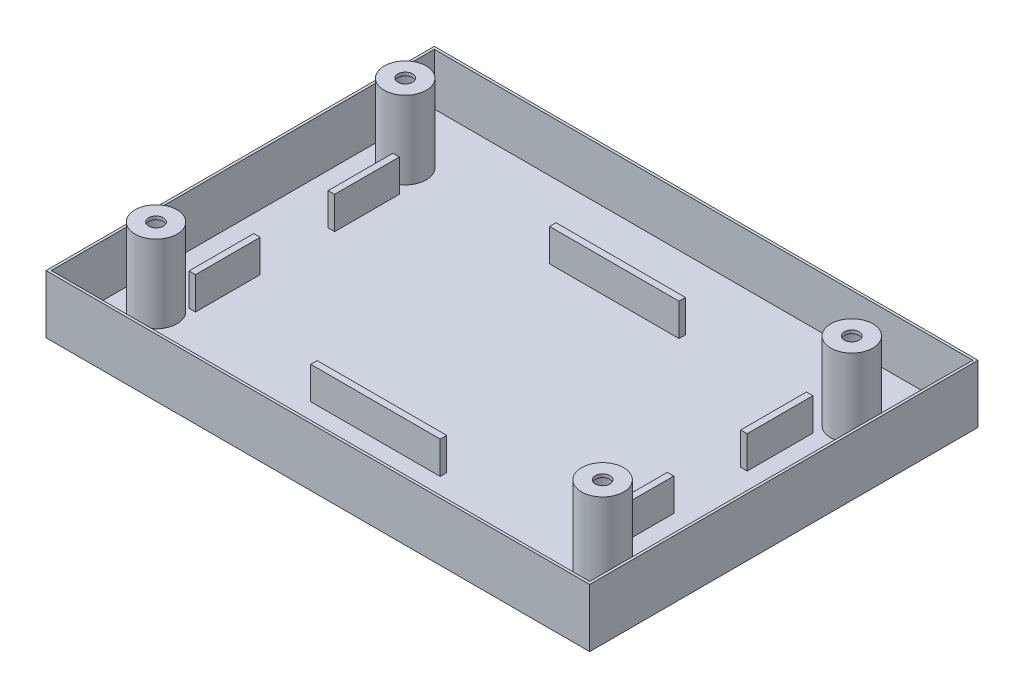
ISO-10303-21;
HEADER;
FILE_DESCRIPTION(('STEP AP214'),'2;1');
FILE_NAME('part.step','',(''),(''),'','','');
FILE_SCHEMA(('AUTOMOTIVE_DESIGN { 1 0 10303 214 1 1 1 1 }'));
ENDSEC;
DATA;
#1=APPLICATION_CONTEXT('core data for automotive mechanical design processes');
#2=APPLICATION_PROTOCOL_DEFINITION('international standard','automotive_design',2000,#1);
#3=PRODUCT_CONTEXT('',#1,'mechanical');
#4=PRODUCT('Part','Part','',(#3));
#5=PRODUCT_RELATED_PRODUCT_CATEGORY('part','',(#4));
#6=PRODUCT_DEFINITION_FORMATION('','',#4);
#7=PRODUCT_DEFINITION_CONTEXT('part definition',#1,'design');
#8=PRODUCT_DEFINITION('design','',#6,#7);
#9=PRODUCT_DEFINITION_SHAPE('','',#8);
#10=(LENGTH_UNIT() NAMED_UNIT(*) SI_UNIT(.MILLI.,.METRE.));
#11=(NAMED_UNIT(*) PLANE_ANGLE_UNIT() SI_UNIT($,.RADIAN.));
#12=(NAMED_UNIT(*) SI_UNIT($,.STERADIAN.) SOLID_ANGLE_UNIT());
#13=UNCERTAINTY_MEASURE_WITH_UNIT(LENGTH_MEASURE(1.E-05),#10,'distance_accuracy_value','');
#14=(GEOMETRIC_REPRESENTATION_CONTEXT(3) GLOBAL_UNCERTAINTY_ASSIGNED_CONTEXT((#13)) GLOBAL_UNIT_ASSIGNED_CONTEXT((#10,
#11,#12)) REPRESENTATION_CONTEXT('',''));
#15=CARTESIAN_POINT('',(0.,0.,0.));
#16=DIRECTION('',(0.,0.,1.));
#17=DIRECTION('',(1.,0.,0.));
#18=AXIS2_PLACEMENT_3D('',#15,#16,#17);
#19=CARTESIAN_POINT('',(0.,0.999999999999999,0.));
#20=DIRECTION('',(0.,-1.,0.));
#21=DIRECTION('',(0.,0.,-1.));
#22=AXIS2_PLACEMENT_3D('',#19,#20,#21);
#23=PLANE('',#22);
#24=CARTESIAN_POINT('',(75.,0.999999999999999,-49.5));
#25=DIRECTION('',(0.,-1.,0.));
#26=DIRECTION('',(0.,0.,-1.));
#27=AXIS2_PLACEMENT_3D('',#24,#25,#26);
#28=CIRCLE('',#27,3.25000000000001);
#29=CARTESIAN_POINT('',(75.,0.999999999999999,-52.75));
#30=VERTEX_POINT('',#29);
#31=EDGE_CURVE('E581',#30,#30,#28,.T.);
#32=ORIENTED_EDGE('',*,*,#31,.T.);
#33=EDGE_LOOP('',(#32));
#34=FACE_BOUND('',#33,.T.);
#35=CARTESIAN_POINT('',(75.,0.999999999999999,-11.));
#36=DIRECTION('',(0.,-1.,0.));
#37=DIRECTION('',(0.,0.,-1.));
#38=AXIS2_PLACEMENT_3D('',#35,#36,#37);
#39=CIRCLE('',#38,3.25000000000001);
#40=CARTESIAN_POINT('',(75.,0.999999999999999,-14.25));
#41=VERTEX_POINT('',#40);
#42=EDGE_CURVE('E586',#41,#41,#39,.T.);
#43=ORIENTED_EDGE('',*,*,#42,.T.);
#44=EDGE_LOOP('',(#43));
#45=FACE_BOUND('',#44,.T.);
#46=CARTESIAN_POINT('',(6.,0.999999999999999,-49.5));
#47=DIRECTION('',(0.,-1.,0.));
#48=DIRECTION('',(0.,0.,-1.));
#49=AXIS2_PLACEMENT_3D('',#46,#47,#48);
#50=CIRCLE('',#49,3.25);
#51=CARTESIAN_POINT('',(6.,0.999999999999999,-52.75));
#52=VERTEX_POINT('',#51);
#53=EDGE_CURVE('E592',#52,#52,#50,.T.);
#54=ORIENTED_EDGE('',*,*,#53,.T.);
#55=EDGE_LOOP('',(#54));
#56=FACE_BOUND('',#55,.T.);
#57=CARTESIAN_POINT('',(6.,0.999999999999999,-11.));
#58=DIRECTION('',(0.,-1.,0.));
#59=DIRECTION('',(0.,0.,-1.));
#60=AXIS2_PLACEMENT_3D('',#57,#58,#59);
#61=CIRCLE('',#60,3.25);
#62=CARTESIAN_POINT('',(6.,0.999999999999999,-14.25));
#63=VERTEX_POINT('',#62);
#64=EDGE_CURVE('E598',#63,#63,#61,.T.);
#65=ORIENTED_EDGE('',*,*,#64,.T.);
#66=EDGE_LOOP('',(#65));
#67=FACE_BOUND('',#66,.T.);
#68=DIRECTION('',(0.,0.,1.));
#69=VECTOR('',#68,1.);
#70=CARTESIAN_POINT('',(72.,0.999999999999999,-45.5));
#71=LINE('',#70,#69);
#72=CARTESIAN_POINT('',(72.,0.999999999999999,-45.5));
#73=VERTEX_POINT('',#72);
#74=CARTESIAN_POINT('',(72.,0.999999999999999,-35.3402251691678));
#75=VERTEX_POINT('',#74);
#76=EDGE_CURVE('E265',#73,#75,#71,.T.);
#77=ORIENTED_EDGE('',*,*,#76,.F.);
#78=DIRECTION('',(-1.,0.,0.));
#79=VECTOR('',#78,1.);
#80=CARTESIAN_POINT('',(72.,0.999999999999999,-45.5));
#81=LINE('',#80,#79);
#82=CARTESIAN_POINT('',(73.,0.999999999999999,-45.5));
#83=VERTEX_POINT('',#82);
#84=EDGE_CURVE('E278',#83,#73,#81,.T.);
#85=ORIENTED_EDGE('',*,*,#84,.F.);
#86=DIRECTION('',(0.,0.,-1.));
#87=VECTOR('',#86,1.);
#88=CARTESIAN_POINT('',(73.,0.999999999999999,-45.5));
#89=LINE('',#88,#87);
#90=CARTESIAN_POINT('',(73.,0.999999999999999,-35.3402251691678));
#91=VERTEX_POINT('',#90);
#92=EDGE_CURVE('E287',#91,#83,#89,.T.);
#93=ORIENTED_EDGE('',*,*,#92,.F.);
#94=DIRECTION('',(1.,0.,0.));
#95=VECTOR('',#94,1.);
#96=CARTESIAN_POINT('',(72.,0.999999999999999,-35.3402251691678));
#97=LINE('',#96,#95);
#98=EDGE_CURVE('E268',#75,#91,#97,.T.);
#99=ORIENTED_EDGE('',*,*,#98,.F.);
#100=EDGE_LOOP('',(#77,#85,#93,#99));
#101=FACE_BOUND('',#100,.T.);
#102=DIRECTION('',(0.,0.,1.));
#103=VECTOR('',#102,1.);
#104=CARTESIAN_POINT('',(8.1,0.999999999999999,-35.5));
#105=LINE('',#104,#103);
#106=CARTESIAN_POINT('',(8.1,0.999999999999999,-45.5));
#107=VERTEX_POINT('',#106);
#108=CARTESIAN_POINT('',(8.1,0.999999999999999,-35.5));
#109=VERTEX_POINT('',#108);
#110=EDGE_CURVE('E336',#107,#109,#105,.T.);
#111=ORIENTED_EDGE('',*,*,#110,.F.);
#112=DIRECTION('',(-1.,0.,0.));
#113=VECTOR('',#112,1.);
#114=CARTESIAN_POINT('',(8.1,0.999999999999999,-45.5));
#115=LINE('',#114,#113);
#116=CARTESIAN_POINT('',(9.1,0.999999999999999,-45.5));
#117=VERTEX_POINT('',#116);
#118=EDGE_CURVE('E341',#117,#107,#115,.T.);
#119=ORIENTED_EDGE('',*,*,#118,.F.);
#120=DIRECTION('',(0.,0.,-1.));
#121=VECTOR('',#120,1.);
#122=CARTESIAN_POINT('',(9.1,0.999999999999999,-35.5));
#123=LINE('',#122,#121);
#124=CARTESIAN_POINT('',(9.1,0.999999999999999,-35.5));
#125=VERTEX_POINT('',#124);
#126=EDGE_CURVE('E353',#125,#117,#123,.T.);
#127=ORIENTED_EDGE('',*,*,#126,.F.);
#128=DIRECTION('',(1.,0.,0.));
#129=VECTOR('',#128,1.);
#130=CARTESIAN_POINT('',(8.1,0.999999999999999,-35.5));
#131=LINE('',#130,#129);
#132=EDGE_CURVE('E350',#109,#125,#131,.T.);
#133=ORIENTED_EDGE('',*,*,#132,.F.);
#134=EDGE_LOOP('',(#111,#119,#127,#133));
#135=FACE_BOUND('',#134,.T.);
#136=DIRECTION('',(0.,0.,1.));
#137=VECTOR('',#136,1.);
#138=CARTESIAN_POINT('',(8.1,0.999999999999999,-14.));
#139=LINE('',#138,#137);
#140=CARTESIAN_POINT('',(8.1,0.999999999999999,-24.));
#141=VERTEX_POINT('',#140);
#142=CARTESIAN_POINT('',(8.1,0.999999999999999,-14.));
#143=VERTEX_POINT('',#142);
#144=EDGE_CURVE('E402',#141,#143,#139,.T.);
#145=ORIENTED_EDGE('',*,*,#144,.F.);
#146=DIRECTION('',(-1.,0.,0.));
#147=VECTOR('',#146,1.);
#148=CARTESIAN_POINT('',(8.1,0.999999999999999,-24.));
#149=LINE('',#148,#147);
#150=CARTESIAN_POINT('',(9.1,0.999999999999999,-24.));
#151=VERTEX_POINT('',#150);
#152=EDGE_CURVE('E407',#151,#141,#149,.T.);
#153=ORIENTED_EDGE('',*,*,#152,.F.);
#154=DIRECTION('',(0.,0.,-1.));
#155=VECTOR('',#154,1.);
#156=CARTESIAN_POINT('',(9.1,0.999999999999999,-14.));
#157=LINE('',#156,#155);
#158=CARTESIAN_POINT('',(9.1,0.999999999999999,-14.));
#159=VERTEX_POINT('',#158);
#160=EDGE_CURVE('E419',#159,#151,#157,.T.);
#161=ORIENTED_EDGE('',*,*,#160,.F.);
#162=DIRECTION('',(1.,0.,0.));
#163=VECTOR('',#162,1.);
#164=CARTESIAN_POINT('',(8.1,0.999999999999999,-14.));
#165=LINE('',#164,#163);
#166=EDGE_CURVE('E416',#143,#159,#165,.T.);
#167=ORIENTED_EDGE('',*,*,#166,.F.);
#168=EDGE_LOOP('',(#145,#153,#161,#167));
#169=FACE_BOUND('',#168,.T.);
#170=DIRECTION('',(0.,0.,1.));
#171=VECTOR('',#170,1.);
#172=CARTESIAN_POINT('',(0.4,0.999999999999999,-0.4));
#173=LINE('',#172,#171);
#174=CARTESIAN_POINT('',(0.4,0.999999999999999,-59.6));
#175=VERTEX_POINT('',#174);
#176=CARTESIAN_POINT('',(0.4,0.999999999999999,-0.4));
#177=VERTEX_POINT('',#176);
#178=EDGE_CURVE('E436',#175,#177,#173,.T.);
#179=ORIENTED_EDGE('',*,*,#178,.T.);
#180=DIRECTION('',(1.,0.,0.));
#181=VECTOR('',#180,1.);
#182=CARTESIAN_POINT('',(0.4,0.999999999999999,-0.4));
#183=LINE('',#182,#181);
#184=CARTESIAN_POINT('',(83.6,0.999999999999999,-0.4));
#185=VERTEX_POINT('',#184);
#186=EDGE_CURVE('E439',#177,#185,#183,.T.);
#187=ORIENTED_EDGE('',*,*,#186,.T.);
#188=DIRECTION('',(0.,0.,-1.));
#189=VECTOR('',#188,1.);
#190=CARTESIAN_POINT('',(83.6,0.999999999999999,-0.4));
#191=LINE('',#190,#189);
#192=CARTESIAN_POINT('',(83.6,0.999999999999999,-59.6));
#193=VERTEX_POINT('',#192);
#194=EDGE_CURVE('E443',#185,#193,#191,.T.);
#195=ORIENTED_EDGE('',*,*,#194,.T.);
#196=DIRECTION('',(-1.,0.,0.));
#197=VECTOR('',#196,1.);
#198=CARTESIAN_POINT('',(0.4,0.999999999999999,-59.6));
#199=LINE('',#198,#197);
#200=EDGE_CURVE('E446',#193,#175,#199,.T.);
#201=ORIENTED_EDGE('',*,*,#200,.T.);
#202=EDGE_LOOP('',(#179,#187,#195,#201));
#203=FACE_BOUND('',#202,.T.);
#204=DIRECTION('',(0.,0.,1.));
#205=VECTOR('',#204,1.);
#206=CARTESIAN_POINT('',(30.,0.999999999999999,-10.9));
#207=LINE('',#206,#205);
#208=CARTESIAN_POINT('',(30.,0.999999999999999,-11.9));
#209=VERTEX_POINT('',#208);
#210=CARTESIAN_POINT('',(30.,0.999999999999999,-10.9));
#211=VERTEX_POINT('',#210);
#212=EDGE_CURVE('E369',#209,#211,#207,.T.);
#213=ORIENTED_EDGE('',*,*,#212,.F.);
#214=DIRECTION('',(-1.,0.,0.));
#215=VECTOR('',#214,1.);
#216=CARTESIAN_POINT('',(30.,0.999999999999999,-11.9));
#217=LINE('',#216,#215);
#218=CARTESIAN_POINT('',(50.,0.999999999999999,-11.9));
#219=VERTEX_POINT('',#218);
#220=EDGE_CURVE('E374',#219,#209,#217,.T.);
#221=ORIENTED_EDGE('',*,*,#220,.F.);
#222=DIRECTION('',(0.,0.,-1.));
#223=VECTOR('',#222,1.);
#224=CARTESIAN_POINT('',(50.,0.999999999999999,-10.9));
#225=LINE('',#224,#223);
#226=CARTESIAN_POINT('',(50.,0.999999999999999,-10.9));
#227=VERTEX_POINT('',#226);
#228=EDGE_CURVE('E386',#227,#219,#225,.T.);
#229=ORIENTED_EDGE('',*,*,#228,.F.);
#230=DIRECTION('',(1.,0.,0.));
#231=VECTOR('',#230,1.);
#232=CARTESIAN_POINT('',(30.,0.999999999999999,-10.9));
#233=LINE('',#232,#231);
#234=EDGE_CURVE('E383',#211,#227,#233,.T.);
#235=ORIENTED_EDGE('',*,*,#234,.F.);
#236=EDGE_LOOP('',(#213,#221,#229,#235));
#237=FACE_BOUND('',#236,.T.);
#238=DIRECTION('',(0.,0.,1.));
#239=VECTOR('',#238,1.);
#240=CARTESIAN_POINT('',(72.,0.999999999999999,-14.));
#241=LINE('',#240,#239);
#242=CARTESIAN_POINT('',(72.,0.999999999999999,-24.));
#243=VERTEX_POINT('',#242);
#244=CARTESIAN_POINT('',(72.,0.999999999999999,-14.));
#245=VERTEX_POINT('',#244);
#246=EDGE_CURVE('E303',#243,#245,#241,.T.);
#247=ORIENTED_EDGE('',*,*,#246,.F.);
#248=DIRECTION('',(-1.,0.,0.));
#249=VECTOR('',#248,1.);
#250=CARTESIAN_POINT('',(72.,0.999999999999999,-24.));
#251=LINE('',#250,#249);
#252=CARTESIAN_POINT('',(73.,0.999999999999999,-24.));
#253=VERTEX_POINT('',#252);
#254=EDGE_CURVE('E308',#253,#243,#251,.T.);
#255=ORIENTED_EDGE('',*,*,#254,.F.);
#256=DIRECTION('',(0.,0.,-1.));
#257=VECTOR('',#256,1.);
#258=CARTESIAN_POINT('',(73.,0.999999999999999,-14.));
#259=LINE('',#258,#257);
#260=CARTESIAN_POINT('',(73.,0.999999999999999,-14.));
#261=VERTEX_POINT('',#260);
#262=EDGE_CURVE('E320',#261,#253,#259,.T.);
#263=ORIENTED_EDGE('',*,*,#262,.F.);
#264=DIRECTION('',(1.,0.,0.));
#265=VECTOR('',#264,1.);
#266=CARTESIAN_POINT('',(72.,0.999999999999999,-14.));
#267=LINE('',#266,#265);
#268=EDGE_CURVE('E317',#245,#261,#267,.T.);
#269=ORIENTED_EDGE('',*,*,#268,.F.);
#270=EDGE_LOOP('',(#247,#255,#263,#269));
#271=FACE_BOUND('',#270,.T.);
#272=DIRECTION('',(0.,0.,1.));
#273=VECTOR('',#272,1.);
#274=CARTESIAN_POINT('',(30.,0.999999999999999,-47.8));
#275=LINE('',#274,#273);
#276=CARTESIAN_POINT('',(30.,0.999999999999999,-48.8));
#277=VERTEX_POINT('',#276);
#278=CARTESIAN_POINT('',(30.,0.999999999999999,-47.8));
#279=VERTEX_POINT('',#278);
#280=EDGE_CURVE('E264',#277,#279,#275,.T.);
#281=ORIENTED_EDGE('',*,*,#280,.F.);
#282=DIRECTION('',(-1.,0.,0.));
#283=VECTOR('',#282,1.);
#284=CARTESIAN_POINT('',(30.,0.999999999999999,-48.8));
#285=LINE('',#284,#283);
#286=CARTESIAN_POINT('',(50.,0.999999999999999,-48.8));
#287=VERTEX_POINT('',#286);
#288=EDGE_CURVE('E261',#287,#277,#285,.T.);
#289=ORIENTED_EDGE('',*,*,#288,.F.);
#290=DIRECTION('',(0.,0.,-1.));
#291=VECTOR('',#290,1.);
#292=CARTESIAN_POINT('',(50.,0.999999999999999,-47.8));
#293=LINE('',#292,#291);
#294=CARTESIAN_POINT('',(50.,0.999999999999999,-47.8));
#295=VERTEX_POINT('',#294);
#296=EDGE_CURVE('E56',#295,#287,#293,.T.);
#297=ORIENTED_EDGE('',*,*,#296,.F.);
#298=DIRECTION('',(1.,0.,0.));
#299=VECTOR('',#298,1.);
#300=CARTESIAN_POINT('',(30.,0.999999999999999,-47.8));
#301=LINE('',#300,#299);
#302=EDGE_CURVE('E51',#279,#295,#301,.T.);
#303=ORIENTED_EDGE('',*,*,#302,.F.);
#304=EDGE_LOOP('',(#281,#289,#297,#303));
#305=FACE_BOUND('',#304,.T.);
#306=ADVANCED_FACE('F34',(#34,#45,#56,#67,#101,#135,#169,#203,#237,#271,#305),#23,.F.);
#307=CARTESIAN_POINT('',(0.,9.,-60.));
#308=DIRECTION('',(0.,0.,-1.));
#309=DIRECTION('',(-1.,0.,0.));
#310=AXIS2_PLACEMENT_3D('',#307,#308,#309);
#311=PLANE('',#310);
#312=DIRECTION('',(1.,0.,0.));
#313=VECTOR('',#312,1.);
#314=CARTESIAN_POINT('',(0.,0.,-60.));
#315=LINE('',#314,#313);
#316=CARTESIAN_POINT('',(0.,0.,-60.));
#317=VERTEX_POINT('',#316);
#318=CARTESIAN_POINT('',(84.,0.,-60.));
#319=VERTEX_POINT('',#318);
#320=EDGE_CURVE('E461',#317,#319,#315,.T.);
#321=ORIENTED_EDGE('',*,*,#320,.F.);
#322=DIRECTION('',(0.,-1.,0.));
#323=VECTOR('',#322,1.);
#324=CARTESIAN_POINT('',(0.,9.,-60.));
#325=LINE('',#324,#323);
#326=CARTESIAN_POINT('',(0.,9.,-60.));
#327=VERTEX_POINT('',#326);
#328=EDGE_CURVE('E11',#327,#317,#325,.T.);
#329=ORIENTED_EDGE('',*,*,#328,.F.);
#330=DIRECTION('',(1.,0.,0.));
#331=VECTOR('',#330,1.);
#332=CARTESIAN_POINT('',(0.,9.,-60.));
#333=LINE('',#332,#331);
#334=CARTESIAN_POINT('',(84.,9.,-60.));
#335=VERTEX_POINT('',#334);
#336=EDGE_CURVE('E468',#327,#335,#333,.T.);
#337=ORIENTED_EDGE('',*,*,#336,.T.);
#338=DIRECTION('',(0.,-1.,0.));
#339=VECTOR('',#338,1.);
#340=CARTESIAN_POINT('',(84.,9.,-60.));
#341=LINE('',#340,#339);
#342=EDGE_CURVE('E38',#335,#319,#341,.T.);
#343=ORIENTED_EDGE('',*,*,#342,.T.);
#344=EDGE_LOOP('',(#321,#329,#337,#343));
#345=FACE_BOUND('',#344,.T.);
#346=ADVANCED_FACE('F36',(#345),#311,.T.);
#347=CARTESIAN_POINT('',(0.,9.,0.));
#348=DIRECTION('',(-1.,0.,0.));
#349=DIRECTION('',(0.,0.,1.));
#350=AXIS2_PLACEMENT_3D('',#347,#348,#349);
#351=PLANE('',#350);
#352=DIRECTION('',(0.,0.,-1.));
#353=VECTOR('',#352,1.);
#354=CARTESIAN_POINT('',(0.,0.,0.));
#355=LINE('',#354,#353);
#356=CARTESIAN_POINT('',(0.,0.,0.));
#357=VERTEX_POINT('',#356);
#358=EDGE_CURVE('E472',#357,#317,#355,.T.);
#359=ORIENTED_EDGE('',*,*,#358,.F.);
#360=DIRECTION('',(0.,-1.,0.));
#361=VECTOR('',#360,1.);
#362=CARTESIAN_POINT('',(0.,9.,0.));
#363=LINE('',#362,#361);
#364=CARTESIAN_POINT('',(0.,9.,0.));
#365=VERTEX_POINT('',#364);
#366=EDGE_CURVE('E43',#365,#357,#363,.T.);
#367=ORIENTED_EDGE('',*,*,#366,.F.);
#368=DIRECTION('',(0.,0.,-1.));
#369=VECTOR('',#368,1.);
#370=CARTESIAN_POINT('',(0.,9.,0.));
#371=LINE('',#370,#369);
#372=EDGE_CURVE('E476',#365,#327,#371,.T.);
#373=ORIENTED_EDGE('',*,*,#372,.T.);
#374=ORIENTED_EDGE('',*,*,#328,.T.);
#375=EDGE_LOOP('',(#359,#367,#373,#374));
#376=FACE_BOUND('',#375,.T.);
#377=ADVANCED_FACE('F504',(#376),#351,.T.);
#378=CARTESIAN_POINT('',(0.,9.,0.));
#379=DIRECTION('',(0.,0.,-1.));
#380=DIRECTION('',(-1.,0.,0.));
#381=AXIS2_PLACEMENT_3D('',#378,#379,#380);
#382=PLANE('',#381);
#383=DIRECTION('',(1.,0.,0.));
#384=VECTOR('',#383,1.);
#385=CARTESIAN_POINT('',(0.,0.,0.));
#386=LINE('',#385,#384);
#387=CARTESIAN_POINT('',(84.,0.,0.));
#388=VERTEX_POINT('',#387);
#389=EDGE_CURVE('E484',#357,#388,#386,.T.);
#390=ORIENTED_EDGE('',*,*,#389,.T.);
#391=DIRECTION('',(0.,-1.,0.));
#392=VECTOR('',#391,1.);
#393=CARTESIAN_POINT('',(84.,9.,0.));
#394=LINE('',#393,#392);
#395=CARTESIAN_POINT('',(84.,9.,0.));
#396=VERTEX_POINT('',#395);
#397=EDGE_CURVE('E488',#396,#388,#394,.T.);
#398=ORIENTED_EDGE('',*,*,#397,.F.);
#399=DIRECTION('',(1.,0.,0.));
#400=VECTOR('',#399,1.);
#401=CARTESIAN_POINT('',(0.,9.,0.));
#402=LINE('',#401,#400);
#403=EDGE_CURVE('E474',#365,#396,#402,.T.);
#404=ORIENTED_EDGE('',*,*,#403,.F.);
#405=ORIENTED_EDGE('',*,*,#366,.T.);
#406=EDGE_LOOP('',(#390,#398,#404,#405));
#407=FACE_BOUND('',#406,.T.);
#408=ADVANCED_FACE('F510',(#407),#382,.F.);
#409=CARTESIAN_POINT('',(84.,9.,0.));
#410=DIRECTION('',(-1.,0.,0.));
#411=DIRECTION('',(0.,0.,1.));
#412=AXIS2_PLACEMENT_3D('',#409,#410,#411);
#413=PLANE('',#412);
#414=DIRECTION('',(0.,0.,-1.));
#415=VECTOR('',#414,1.);
#416=CARTESIAN_POINT('',(84.,0.,0.));
#417=LINE('',#416,#415);
#418=EDGE_CURVE('E481',#388,#319,#417,.T.);
#419=ORIENTED_EDGE('',*,*,#418,.T.);
#420=ORIENTED_EDGE('',*,*,#342,.F.);
#421=DIRECTION('',(0.,0.,-1.));
#422=VECTOR('',#421,1.);
#423=CARTESIAN_POINT('',(84.,9.,0.));
#424=LINE('',#423,#422);
#425=EDGE_CURVE('E471',#396,#335,#424,.T.);
#426=ORIENTED_EDGE('',*,*,#425,.F.);
#427=ORIENTED_EDGE('',*,*,#397,.T.);
#428=EDGE_LOOP('',(#419,#420,#426,#427));
#429=FACE_BOUND('',#428,.T.);
#430=ADVANCED_FACE('F498',(#429),#413,.F.);
#431=CARTESIAN_POINT('',(0.,9.,0.));
#432=DIRECTION('',(0.,1.,0.));
#433=DIRECTION('',(0.,0.,1.));
#434=AXIS2_PLACEMENT_3D('',#431,#432,#433);
#435=PLANE('',#434);
#436=DIRECTION('',(0.,0.,1.));
#437=VECTOR('',#436,1.);
#438=CARTESIAN_POINT('',(0.4,9.,-0.4));
#439=LINE('',#438,#437);
#440=CARTESIAN_POINT('',(0.4,9.,-59.6));
#441=VERTEX_POINT('',#440);
#442=CARTESIAN_POINT('',(0.4,9.,-0.4));
#443=VERTEX_POINT('',#442);
#444=EDGE_CURVE('E435',#441,#443,#439,.T.);
#445=ORIENTED_EDGE('',*,*,#444,.F.);
#446=DIRECTION('',(-1.,0.,0.));
#447=VECTOR('',#446,1.);
#448=CARTESIAN_POINT('',(0.4,9.,-59.6));
#449=LINE('',#448,#447);
#450=CARTESIAN_POINT('',(83.6,9.,-59.6));
#451=VERTEX_POINT('',#450);
#452=EDGE_CURVE('E440',#451,#441,#449,.T.);
#453=ORIENTED_EDGE('',*,*,#452,.F.);
#454=DIRECTION('',(0.,0.,-1.));
#455=VECTOR('',#454,1.);
#456=CARTESIAN_POINT('',(83.6,9.,-0.4));
#457=LINE('',#456,#455);
#458=CARTESIAN_POINT('',(83.6,9.,-0.4));
#459=VERTEX_POINT('',#458);
#460=EDGE_CURVE('E454',#459,#451,#457,.T.);
#461=ORIENTED_EDGE('',*,*,#460,.F.);
#462=DIRECTION('',(1.,0.,0.));
#463=VECTOR('',#462,1.);
#464=CARTESIAN_POINT('',(0.4,9.,-0.4));
#465=LINE('',#464,#463);
#466=EDGE_CURVE('E451',#443,#459,#465,.T.);
#467=ORIENTED_EDGE('',*,*,#466,.F.);
#468=EDGE_LOOP('',(#445,#453,#461,#467));
#469=FACE_BOUND('',#468,.T.);
#470=ORIENTED_EDGE('',*,*,#336,.F.);
#471=ORIENTED_EDGE('',*,*,#372,.F.);
#472=ORIENTED_EDGE('',*,*,#403,.T.);
#473=ORIENTED_EDGE('',*,*,#425,.T.);
#474=EDGE_LOOP('',(#470,#471,#472,#473));
#475=FACE_BOUND('',#474,.T.);
#476=ADVANCED_FACE('F508',(#469,#475),#435,.T.);
#477=CARTESIAN_POINT('',(0.,0.,0.));
#478=DIRECTION('',(0.,1.,0.));
#479=DIRECTION('',(0.,0.,1.));
#480=AXIS2_PLACEMENT_3D('',#477,#478,#479);
#481=PLANE('',#480);
#482=CARTESIAN_POINT('',(6.,0.,-49.5));
#483=DIRECTION('',(0.,-1.,0.));
#484=DIRECTION('',(0.,0.,-1.));
#485=AXIS2_PLACEMENT_3D('',#482,#483,#484);
#486=CIRCLE('',#485,2.9);
#487=CARTESIAN_POINT('',(6.,0.,-52.4));
#488=VERTEX_POINT('',#487);
#489=EDGE_CURVE('E556',#488,#488,#486,.T.);
#490=ORIENTED_EDGE('',*,*,#489,.F.);
#491=EDGE_LOOP('',(#490));
#492=FACE_BOUND('',#491,.T.);
#493=CARTESIAN_POINT('',(75.,0.,-11.));
#494=DIRECTION('',(0.,-1.,0.));
#495=DIRECTION('',(0.,0.,-1.));
#496=AXIS2_PLACEMENT_3D('',#493,#494,#495);
#497=CIRCLE('',#496,2.9);
#498=CARTESIAN_POINT('',(75.,0.,-13.9));
#499=VERTEX_POINT('',#498);
#500=EDGE_CURVE('E560',#499,#499,#497,.T.);
#501=ORIENTED_EDGE('',*,*,#500,.F.);
#502=EDGE_LOOP('',(#501));
#503=FACE_BOUND('',#502,.T.);
#504=CARTESIAN_POINT('',(75.,0.,-49.5));
#505=DIRECTION('',(0.,-1.,0.));
#506=DIRECTION('',(0.,0.,-1.));
#507=AXIS2_PLACEMENT_3D('',#504,#505,#506);
#508=CIRCLE('',#507,2.9);
#509=CARTESIAN_POINT('',(75.,0.,-52.4));
#510=VERTEX_POINT('',#509);
#511=EDGE_CURVE('E564',#510,#510,#508,.T.);
#512=ORIENTED_EDGE('',*,*,#511,.F.);
#513=EDGE_LOOP('',(#512));
#514=FACE_BOUND('',#513,.T.);
#515=CARTESIAN_POINT('',(6.,0.,-11.));
#516=DIRECTION('',(0.,-1.,0.));
#517=DIRECTION('',(0.,0.,-1.));
#518=AXIS2_PLACEMENT_3D('',#515,#516,#517);
#519=CIRCLE('',#518,2.9);
#520=CARTESIAN_POINT('',(6.,0.,-13.9));
#521=VERTEX_POINT('',#520);
#522=EDGE_CURVE('E567',#521,#521,#519,.T.);
#523=ORIENTED_EDGE('',*,*,#522,.F.);
#524=EDGE_LOOP('',(#523));
#525=FACE_BOUND('',#524,.T.);
#526=ORIENTED_EDGE('',*,*,#320,.T.);
#527=ORIENTED_EDGE('',*,*,#418,.F.);
#528=ORIENTED_EDGE('',*,*,#389,.F.);
#529=ORIENTED_EDGE('',*,*,#358,.T.);
#530=EDGE_LOOP('',(#526,#527,#528,#529));
#531=FACE_BOUND('',#530,.T.);
#532=ADVANCED_FACE('F501',(#492,#503,#514,#525,#531),#481,.F.);
#533=CARTESIAN_POINT('',(0.4,0.999999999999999,-0.4));
#534=DIRECTION('',(-1.,0.,0.));
#535=DIRECTION('',(0.,0.,1.));
#536=AXIS2_PLACEMENT_3D('',#533,#534,#535);
#537=PLANE('',#536);
#538=ORIENTED_EDGE('',*,*,#444,.T.);
#539=DIRECTION('',(0.,1.,0.));
#540=VECTOR('',#539,1.);
#541=CARTESIAN_POINT('',(0.4,0.999999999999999,-0.4));
#542=LINE('',#541,#540);
#543=EDGE_CURVE('E449',#177,#443,#542,.T.);
#544=ORIENTED_EDGE('',*,*,#543,.F.);
#545=ORIENTED_EDGE('',*,*,#178,.F.);
#546=DIRECTION('',(0.,1.,0.));
#547=VECTOR('',#546,1.);
#548=CARTESIAN_POINT('',(0.4,0.999999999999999,-59.6));
#549=LINE('',#548,#547);
#550=EDGE_CURVE('E459',#175,#441,#549,.T.);
#551=ORIENTED_EDGE('',*,*,#550,.T.);
#552=EDGE_LOOP('',(#538,#544,#545,#551));
#553=FACE_BOUND('',#552,.T.);
#554=ADVANCED_FACE('F534',(#553),#537,.F.);
#555=CARTESIAN_POINT('',(0.4,0.999999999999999,-59.6));
#556=DIRECTION('',(0.,0.,-1.));
#557=DIRECTION('',(-1.,0.,0.));
#558=AXIS2_PLACEMENT_3D('',#555,#556,#557);
#559=PLANE('',#558);
#560=ORIENTED_EDGE('',*,*,#452,.T.);
#561=ORIENTED_EDGE('',*,*,#550,.F.);
#562=ORIENTED_EDGE('',*,*,#200,.F.);
#563=DIRECTION('',(0.,1.,0.));
#564=VECTOR('',#563,1.);
#565=CARTESIAN_POINT('',(83.6,0.999999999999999,-59.6));
#566=LINE('',#565,#564);
#567=EDGE_CURVE('E462',#193,#451,#566,.T.);
#568=ORIENTED_EDGE('',*,*,#567,.T.);
#569=EDGE_LOOP('',(#560,#561,#562,#568));
#570=FACE_BOUND('',#569,.T.);
#571=ADVANCED_FACE('F530',(#570),#559,.F.);
#572=CARTESIAN_POINT('',(83.6,0.999999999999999,-0.4));
#573=DIRECTION('',(1.,0.,0.));
#574=DIRECTION('',(0.,0.,-1.));
#575=AXIS2_PLACEMENT_3D('',#572,#573,#574);
#576=PLANE('',#575);
#577=ORIENTED_EDGE('',*,*,#460,.T.);
#578=ORIENTED_EDGE('',*,*,#567,.F.);
#579=ORIENTED_EDGE('',*,*,#194,.F.);
#580=DIRECTION('',(0.,1.,0.));
#581=VECTOR('',#580,1.);
#582=CARTESIAN_POINT('',(83.6,0.999999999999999,-0.4));
#583=LINE('',#582,#581);
#584=EDGE_CURVE('E464',#185,#459,#583,.T.);
#585=ORIENTED_EDGE('',*,*,#584,.T.);
#586=EDGE_LOOP('',(#577,#578,#579,#585));
#587=FACE_BOUND('',#586,.T.);
#588=ADVANCED_FACE('F533',(#587),#576,.F.);
#589=CARTESIAN_POINT('',(0.4,0.999999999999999,-0.4));
#590=DIRECTION('',(0.,0.,1.));
#591=DIRECTION('',(1.,0.,0.));
#592=AXIS2_PLACEMENT_3D('',#589,#590,#591);
#593=PLANE('',#592);
#594=ORIENTED_EDGE('',*,*,#466,.T.);
#595=ORIENTED_EDGE('',*,*,#584,.F.);
#596=ORIENTED_EDGE('',*,*,#186,.F.);
#597=ORIENTED_EDGE('',*,*,#543,.T.);
#598=EDGE_LOOP('',(#594,#595,#596,#597));
#599=FACE_BOUND('',#598,.T.);
#600=ADVANCED_FACE('F538',(#599),#593,.F.);
#601=CARTESIAN_POINT('',(8.1,6.,-14.));
#602=DIRECTION('',(1.,0.,0.));
#603=DIRECTION('',(0.,0.,-1.));
#604=AXIS2_PLACEMENT_3D('',#601,#602,#603);
#605=PLANE('',#604);
#606=ORIENTED_EDGE('',*,*,#144,.T.);
#607=DIRECTION('',(0.,-1.,0.));
#608=VECTOR('',#607,1.);
#609=CARTESIAN_POINT('',(8.1,6.,-14.));
#610=LINE('',#609,#608);
#611=CARTESIAN_POINT('',(8.1,6.,-14.));
#612=VERTEX_POINT('',#611);
#613=EDGE_CURVE('E432',#612,#143,#610,.T.);
#614=ORIENTED_EDGE('',*,*,#613,.F.);
#615=DIRECTION('',(0.,0.,1.));
#616=VECTOR('',#615,1.);
#617=CARTESIAN_POINT('',(8.1,6.,-14.));
#618=LINE('',#617,#616);
#619=CARTESIAN_POINT('',(8.1,6.,-24.));
#620=VERTEX_POINT('',#619);
#621=EDGE_CURVE('E403',#620,#612,#618,.T.);
#622=ORIENTED_EDGE('',*,*,#621,.F.);
#623=DIRECTION('',(0.,-1.,0.));
#624=VECTOR('',#623,1.);
#625=CARTESIAN_POINT('',(8.1,6.,-24.));
#626=LINE('',#625,#624);
#627=EDGE_CURVE('E413',#620,#141,#626,.T.);
#628=ORIENTED_EDGE('',*,*,#627,.T.);
#629=EDGE_LOOP('',(#606,#614,#622,#628));
#630=FACE_BOUND('',#629,.T.);
#631=ADVANCED_FACE('F528',(#630),#605,.F.);
#632=CARTESIAN_POINT('',(8.1,6.,-14.));
#633=DIRECTION('',(0.,0.,-1.));
#634=DIRECTION('',(-1.,0.,0.));
#635=AXIS2_PLACEMENT_3D('',#632,#633,#634);
#636=PLANE('',#635);
#637=ORIENTED_EDGE('',*,*,#166,.T.);
#638=DIRECTION('',(0.,-1.,0.));
#639=VECTOR('',#638,1.);
#640=CARTESIAN_POINT('',(9.1,6.,-14.));
#641=LINE('',#640,#639);
#642=CARTESIAN_POINT('',(9.1,6.,-14.));
#643=VERTEX_POINT('',#642);
#644=EDGE_CURVE('E429',#643,#159,#641,.T.);
#645=ORIENTED_EDGE('',*,*,#644,.F.);
#646=DIRECTION('',(1.,0.,0.));
#647=VECTOR('',#646,1.);
#648=CARTESIAN_POINT('',(8.1,6.,-14.));
#649=LINE('',#648,#647);
#650=EDGE_CURVE('E406',#612,#643,#649,.T.);
#651=ORIENTED_EDGE('',*,*,#650,.F.);
#652=ORIENTED_EDGE('',*,*,#613,.T.);
#653=EDGE_LOOP('',(#637,#645,#651,#652));
#654=FACE_BOUND('',#653,.T.);
#655=ADVANCED_FACE('F717',(#654),#636,.F.);
#656=CARTESIAN_POINT('',(9.1,6.,-14.));
#657=DIRECTION('',(-1.,0.,0.));
#658=DIRECTION('',(0.,0.,1.));
#659=AXIS2_PLACEMENT_3D('',#656,#657,#658);
#660=PLANE('',#659);
#661=ORIENTED_EDGE('',*,*,#160,.T.);
#662=DIRECTION('',(0.,-1.,0.));
#663=VECTOR('',#662,1.);
#664=CARTESIAN_POINT('',(9.1,6.,-24.));
#665=LINE('',#664,#663);
#666=CARTESIAN_POINT('',(9.1,6.,-24.));
#667=VERTEX_POINT('',#666);
#668=EDGE_CURVE('E426',#667,#151,#665,.T.);
#669=ORIENTED_EDGE('',*,*,#668,.F.);
#670=DIRECTION('',(0.,0.,-1.));
#671=VECTOR('',#670,1.);
#672=CARTESIAN_POINT('',(9.1,6.,-14.));
#673=LINE('',#672,#671);
#674=EDGE_CURVE('E409',#643,#667,#673,.T.);
#675=ORIENTED_EDGE('',*,*,#674,.F.);
#676=ORIENTED_EDGE('',*,*,#644,.T.);
#677=EDGE_LOOP('',(#661,#669,#675,#676));
#678=FACE_BOUND('',#677,.T.);
#679=ADVANCED_FACE('F714',(#678),#660,.F.);
#680=CARTESIAN_POINT('',(8.1,6.,-24.));
#681=DIRECTION('',(0.,0.,1.));
#682=DIRECTION('',(1.,0.,0.));
#683=AXIS2_PLACEMENT_3D('',#680,#681,#682);
#684=PLANE('',#683);
#685=ORIENTED_EDGE('',*,*,#152,.T.);
#686=ORIENTED_EDGE('',*,*,#627,.F.);
#687=DIRECTION('',(-1.,0.,0.));
#688=VECTOR('',#687,1.);
#689=CARTESIAN_POINT('',(8.1,6.,-24.));
#690=LINE('',#689,#688);
#691=EDGE_CURVE('E411',#667,#620,#690,.T.);
#692=ORIENTED_EDGE('',*,*,#691,.F.);
#693=ORIENTED_EDGE('',*,*,#668,.T.);
#694=EDGE_LOOP('',(#685,#686,#692,#693));
#695=FACE_BOUND('',#694,.T.);
#696=ADVANCED_FACE('F710',(#695),#684,.F.);
#697=CARTESIAN_POINT('',(0.,6.,0.));
#698=DIRECTION('',(0.,-1.,0.));
#699=DIRECTION('',(0.,0.,-1.));
#700=AXIS2_PLACEMENT_3D('',#697,#698,#699);
#701=PLANE('',#700);
#702=ORIENTED_EDGE('',*,*,#621,.T.);
#703=ORIENTED_EDGE('',*,*,#650,.T.);
#704=ORIENTED_EDGE('',*,*,#674,.T.);
#705=ORIENTED_EDGE('',*,*,#691,.T.);
#706=EDGE_LOOP('',(#702,#703,#704,#705));
#707=FACE_BOUND('',#706,.T.);
#708=ADVANCED_FACE('F706',(#707),#701,.F.);
#709=CARTESIAN_POINT('',(30.,6.,-10.9));
#710=DIRECTION('',(1.,0.,0.));
#711=DIRECTION('',(0.,0.,-1.));
#712=AXIS2_PLACEMENT_3D('',#709,#710,#711);
#713=PLANE('',#712);
#714=ORIENTED_EDGE('',*,*,#212,.T.);
#715=DIRECTION('',(0.,-1.,0.));
#716=VECTOR('',#715,1.);
#717=CARTESIAN_POINT('',(30.,6.,-10.9));
#718=LINE('',#717,#716);
#719=CARTESIAN_POINT('',(30.,6.,-10.9));
#720=VERTEX_POINT('',#719);
#721=EDGE_CURVE('E399',#720,#211,#718,.T.);
#722=ORIENTED_EDGE('',*,*,#721,.F.);
#723=DIRECTION('',(0.,0.,1.));
#724=VECTOR('',#723,1.);
#725=CARTESIAN_POINT('',(30.,6.,-10.9));
#726=LINE('',#725,#724);
#727=CARTESIAN_POINT('',(30.,6.,-11.9));
#728=VERTEX_POINT('',#727);
#729=EDGE_CURVE('E370',#728,#720,#726,.T.);
#730=ORIENTED_EDGE('',*,*,#729,.F.);
#731=DIRECTION('',(0.,-1.,0.));
#732=VECTOR('',#731,1.);
#733=CARTESIAN_POINT('',(30.,6.,-11.9));
#734=LINE('',#733,#732);
#735=EDGE_CURVE('E380',#728,#209,#734,.T.);
#736=ORIENTED_EDGE('',*,*,#735,.T.);
#737=EDGE_LOOP('',(#714,#722,#730,#736));
#738=FACE_BOUND('',#737,.T.);
#739=ADVANCED_FACE('F702',(#738),#713,.F.);
#740=CARTESIAN_POINT('',(30.,6.,-10.9));
#741=DIRECTION('',(0.,0.,-1.));
#742=DIRECTION('',(-1.,0.,0.));
#743=AXIS2_PLACEMENT_3D('',#740,#741,#742);
#744=PLANE('',#743);
#745=ORIENTED_EDGE('',*,*,#234,.T.);
#746=DIRECTION('',(0.,-1.,0.));
#747=VECTOR('',#746,1.);
#748=CARTESIAN_POINT('',(50.,6.,-10.9));
#749=LINE('',#748,#747);
#750=CARTESIAN_POINT('',(50.,6.,-10.9));
#751=VERTEX_POINT('',#750);
#752=EDGE_CURVE('E396',#751,#227,#749,.T.);
#753=ORIENTED_EDGE('',*,*,#752,.F.);
#754=DIRECTION('',(1.,0.,0.));
#755=VECTOR('',#754,1.);
#756=CARTESIAN_POINT('',(30.,6.,-10.9));
#757=LINE('',#756,#755);
#758=EDGE_CURVE('E373',#720,#751,#757,.T.);
#759=ORIENTED_EDGE('',*,*,#758,.F.);
#760=ORIENTED_EDGE('',*,*,#721,.T.);
#761=EDGE_LOOP('',(#745,#753,#759,#760));
#762=FACE_BOUND('',#761,.T.);
#763=ADVANCED_FACE('F698',(#762),#744,.F.);
#764=CARTESIAN_POINT('',(50.,6.,-10.9));
#765=DIRECTION('',(-1.,0.,0.));
#766=DIRECTION('',(0.,0.,1.));
#767=AXIS2_PLACEMENT_3D('',#764,#765,#766);
#768=PLANE('',#767);
#769=ORIENTED_EDGE('',*,*,#228,.T.);
#770=DIRECTION('',(0.,-1.,0.));
#771=VECTOR('',#770,1.);
#772=CARTESIAN_POINT('',(50.,6.,-11.9));
#773=LINE('',#772,#771);
#774=CARTESIAN_POINT('',(50.,6.,-11.9));
#775=VERTEX_POINT('',#774);
#776=EDGE_CURVE('E393',#775,#219,#773,.T.);
#777=ORIENTED_EDGE('',*,*,#776,.F.);
#778=DIRECTION('',(0.,0.,-1.));
#779=VECTOR('',#778,1.);
#780=CARTESIAN_POINT('',(50.,6.,-10.9));
#781=LINE('',#780,#779);
#782=EDGE_CURVE('E376',#751,#775,#781,.T.);
#783=ORIENTED_EDGE('',*,*,#782,.F.);
#784=ORIENTED_EDGE('',*,*,#752,.T.);
#785=EDGE_LOOP('',(#769,#777,#783,#784));
#786=FACE_BOUND('',#785,.T.);
#787=ADVANCED_FACE('F694',(#786),#768,.F.);
#788=CARTESIAN_POINT('',(30.,6.,-11.9));
#789=DIRECTION('',(0.,0.,1.));
#790=DIRECTION('',(1.,0.,0.));
#791=AXIS2_PLACEMENT_3D('',#788,#789,#790);
#792=PLANE('',#791);
#793=ORIENTED_EDGE('',*,*,#220,.T.);
#794=ORIENTED_EDGE('',*,*,#735,.F.);
#795=DIRECTION('',(-1.,0.,0.));
#796=VECTOR('',#795,1.);
#797=CARTESIAN_POINT('',(30.,6.,-11.9));
#798=LINE('',#797,#796);
#799=EDGE_CURVE('E378',#775,#728,#798,.T.);
#800=ORIENTED_EDGE('',*,*,#799,.F.);
#801=ORIENTED_EDGE('',*,*,#776,.T.);
#802=EDGE_LOOP('',(#793,#794,#800,#801));
#803=FACE_BOUND('',#802,.T.);
#804=ADVANCED_FACE('F690',(#803),#792,.F.);
#805=CARTESIAN_POINT('',(0.,6.,0.));
#806=DIRECTION('',(0.,-1.,0.));
#807=DIRECTION('',(0.,0.,-1.));
#808=AXIS2_PLACEMENT_3D('',#805,#806,#807);
#809=PLANE('',#808);
#810=ORIENTED_EDGE('',*,*,#729,.T.);
#811=ORIENTED_EDGE('',*,*,#758,.T.);
#812=ORIENTED_EDGE('',*,*,#782,.T.);
#813=ORIENTED_EDGE('',*,*,#799,.T.);
#814=EDGE_LOOP('',(#810,#811,#812,#813));
#815=FACE_BOUND('',#814,.T.);
#816=ADVANCED_FACE('F686',(#815),#809,.F.);
#817=CARTESIAN_POINT('',(8.1,6.,-35.5));
#818=DIRECTION('',(1.,0.,0.));
#819=DIRECTION('',(0.,0.,-1.));
#820=AXIS2_PLACEMENT_3D('',#817,#818,#819);
#821=PLANE('',#820);
#822=ORIENTED_EDGE('',*,*,#110,.T.);
#823=DIRECTION('',(0.,-1.,0.));
#824=VECTOR('',#823,1.);
#825=CARTESIAN_POINT('',(8.1,6.,-35.5));
#826=LINE('',#825,#824);
#827=CARTESIAN_POINT('',(8.1,6.,-35.5));
#828=VERTEX_POINT('',#827);
#829=EDGE_CURVE('E366',#828,#109,#826,.T.);
#830=ORIENTED_EDGE('',*,*,#829,.F.);
#831=DIRECTION('',(0.,0.,1.));
#832=VECTOR('',#831,1.);
#833=CARTESIAN_POINT('',(8.1,6.,-35.5));
#834=LINE('',#833,#832);
#835=CARTESIAN_POINT('',(8.1,6.,-45.5));
#836=VERTEX_POINT('',#835);
#837=EDGE_CURVE('E337',#836,#828,#834,.T.);
#838=ORIENTED_EDGE('',*,*,#837,.F.);
#839=DIRECTION('',(0.,-1.,0.));
#840=VECTOR('',#839,1.);
#841=CARTESIAN_POINT('',(8.1,6.,-45.5));
#842=LINE('',#841,#840);
#843=EDGE_CURVE('E347',#836,#107,#842,.T.);
#844=ORIENTED_EDGE('',*,*,#843,.T.);
#845=EDGE_LOOP('',(#822,#830,#838,#844));
#846=FACE_BOUND('',#845,.T.);
#847=ADVANCED_FACE('F682',(#846),#821,.F.);
#848=CARTESIAN_POINT('',(8.1,6.,-35.5));
#849=DIRECTION('',(0.,0.,-1.));
#850=DIRECTION('',(-1.,0.,0.));
#851=AXIS2_PLACEMENT_3D('',#848,#849,#850);
#852=PLANE('',#851);
#853=ORIENTED_EDGE('',*,*,#132,.T.);
#854=DIRECTION('',(0.,-1.,0.));
#855=VECTOR('',#854,1.);
#856=CARTESIAN_POINT('',(9.1,6.,-35.5));
#857=LINE('',#856,#855);
#858=CARTESIAN_POINT('',(9.1,6.,-35.5));
#859=VERTEX_POINT('',#858);
#860=EDGE_CURVE('E363',#859,#125,#857,.T.);
#861=ORIENTED_EDGE('',*,*,#860,.F.);
#862=DIRECTION('',(1.,0.,0.));
#863=VECTOR('',#862,1.);
#864=CARTESIAN_POINT('',(8.1,6.,-35.5));
#865=LINE('',#864,#863);
#866=EDGE_CURVE('E340',#828,#859,#865,.T.);
#867=ORIENTED_EDGE('',*,*,#866,.F.);
#868=ORIENTED_EDGE('',*,*,#829,.T.);
#869=EDGE_LOOP('',(#853,#861,#867,#868));
#870=FACE_BOUND('',#869,.T.);
#871=ADVANCED_FACE('F678',(#870),#852,.F.);
#872=CARTESIAN_POINT('',(9.1,6.,-35.5));
#873=DIRECTION('',(-1.,0.,0.));
#874=DIRECTION('',(0.,0.,1.));
#875=AXIS2_PLACEMENT_3D('',#872,#873,#874);
#876=PLANE('',#875);
#877=ORIENTED_EDGE('',*,*,#126,.T.);
#878=DIRECTION('',(0.,-1.,0.));
#879=VECTOR('',#878,1.);
#880=CARTESIAN_POINT('',(9.1,6.,-45.5));
#881=LINE('',#880,#879);
#882=CARTESIAN_POINT('',(9.1,6.,-45.5));
#883=VERTEX_POINT('',#882);
#884=EDGE_CURVE('E360',#883,#117,#881,.T.);
#885=ORIENTED_EDGE('',*,*,#884,.F.);
#886=DIRECTION('',(0.,0.,-1.));
#887=VECTOR('',#886,1.);
#888=CARTESIAN_POINT('',(9.1,6.,-35.5));
#889=LINE('',#888,#887);
#890=EDGE_CURVE('E343',#859,#883,#889,.T.);
#891=ORIENTED_EDGE('',*,*,#890,.F.);
#892=ORIENTED_EDGE('',*,*,#860,.T.);
#893=EDGE_LOOP('',(#877,#885,#891,#892));
#894=FACE_BOUND('',#893,.T.);
#895=ADVANCED_FACE('F674',(#894),#876,.F.);
#896=CARTESIAN_POINT('',(8.1,6.,-45.5));
#897=DIRECTION('',(0.,0.,1.));
#898=DIRECTION('',(1.,0.,0.));
#899=AXIS2_PLACEMENT_3D('',#896,#897,#898);
#900=PLANE('',#899);
#901=ORIENTED_EDGE('',*,*,#118,.T.);
#902=ORIENTED_EDGE('',*,*,#843,.F.);
#903=DIRECTION('',(-1.,0.,0.));
#904=VECTOR('',#903,1.);
#905=CARTESIAN_POINT('',(8.1,6.,-45.5));
#906=LINE('',#905,#904);
#907=EDGE_CURVE('E345',#883,#836,#906,.T.);
#908=ORIENTED_EDGE('',*,*,#907,.F.);
#909=ORIENTED_EDGE('',*,*,#884,.T.);
#910=EDGE_LOOP('',(#901,#902,#908,#909));
#911=FACE_BOUND('',#910,.T.);
#912=ADVANCED_FACE('F670',(#911),#900,.F.);
#913=CARTESIAN_POINT('',(0.,6.,0.));
#914=DIRECTION('',(0.,-1.,0.));
#915=DIRECTION('',(0.,0.,-1.));
#916=AXIS2_PLACEMENT_3D('',#913,#914,#915);
#917=PLANE('',#916);
#918=ORIENTED_EDGE('',*,*,#837,.T.);
#919=ORIENTED_EDGE('',*,*,#866,.T.);
#920=ORIENTED_EDGE('',*,*,#890,.T.);
#921=ORIENTED_EDGE('',*,*,#907,.T.);
#922=EDGE_LOOP('',(#918,#919,#920,#921));
#923=FACE_BOUND('',#922,.T.);
#924=ADVANCED_FACE('F666',(#923),#917,.F.);
#925=CARTESIAN_POINT('',(72.,6.,-14.));
#926=DIRECTION('',(1.,0.,0.));
#927=DIRECTION('',(0.,0.,-1.));
#928=AXIS2_PLACEMENT_3D('',#925,#926,#927);
#929=PLANE('',#928);
#930=ORIENTED_EDGE('',*,*,#246,.T.);
#931=DIRECTION('',(0.,-1.,0.));
#932=VECTOR('',#931,1.);
#933=CARTESIAN_POINT('',(72.,6.,-14.));
#934=LINE('',#933,#932);
#935=CARTESIAN_POINT('',(72.,6.,-14.));
#936=VERTEX_POINT('',#935);
#937=EDGE_CURVE('E333',#936,#245,#934,.T.);
#938=ORIENTED_EDGE('',*,*,#937,.F.);
#939=DIRECTION('',(0.,0.,1.));
#940=VECTOR('',#939,1.);
#941=CARTESIAN_POINT('',(72.,6.,-14.));
#942=LINE('',#941,#940);
#943=CARTESIAN_POINT('',(72.,6.,-24.));
#944=VERTEX_POINT('',#943);
#945=EDGE_CURVE('E304',#944,#936,#942,.T.);
#946=ORIENTED_EDGE('',*,*,#945,.F.);
#947=DIRECTION('',(0.,-1.,0.));
#948=VECTOR('',#947,1.);
#949=CARTESIAN_POINT('',(72.,6.,-24.));
#950=LINE('',#949,#948);
#951=EDGE_CURVE('E314',#944,#243,#950,.T.);
#952=ORIENTED_EDGE('',*,*,#951,.T.);
#953=EDGE_LOOP('',(#930,#938,#946,#952));
#954=FACE_BOUND('',#953,.T.);
#955=ADVANCED_FACE('F662',(#954),#929,.F.);
#956=CARTESIAN_POINT('',(72.,6.,-14.));
#957=DIRECTION('',(0.,0.,-1.));
#958=DIRECTION('',(-1.,0.,0.));
#959=AXIS2_PLACEMENT_3D('',#956,#957,#958);
#960=PLANE('',#959);
#961=ORIENTED_EDGE('',*,*,#268,.T.);
#962=DIRECTION('',(0.,-1.,0.));
#963=VECTOR('',#962,1.);
#964=CARTESIAN_POINT('',(73.,6.,-14.));
#965=LINE('',#964,#963);
#966=CARTESIAN_POINT('',(73.,6.,-14.));
#967=VERTEX_POINT('',#966);
#968=EDGE_CURVE('E330',#967,#261,#965,.T.);
#969=ORIENTED_EDGE('',*,*,#968,.F.);
#970=DIRECTION('',(1.,0.,0.));
#971=VECTOR('',#970,1.);
#972=CARTESIAN_POINT('',(72.,6.,-14.));
#973=LINE('',#972,#971);
#974=EDGE_CURVE('E307',#936,#967,#973,.T.);
#975=ORIENTED_EDGE('',*,*,#974,.F.);
#976=ORIENTED_EDGE('',*,*,#937,.T.);
#977=EDGE_LOOP('',(#961,#969,#975,#976));
#978=FACE_BOUND('',#977,.T.);
#979=ADVANCED_FACE('F658',(#978),#960,.F.);
#980=CARTESIAN_POINT('',(73.,6.,-14.));
#981=DIRECTION('',(-1.,0.,0.));
#982=DIRECTION('',(0.,0.,1.));
#983=AXIS2_PLACEMENT_3D('',#980,#981,#982);
#984=PLANE('',#983);
#985=ORIENTED_EDGE('',*,*,#262,.T.);
#986=DIRECTION('',(0.,-1.,0.));
#987=VECTOR('',#986,1.);
#988=CARTESIAN_POINT('',(73.,6.,-24.));
#989=LINE('',#988,#987);
#990=CARTESIAN_POINT('',(73.,6.,-24.));
#991=VERTEX_POINT('',#990);
#992=EDGE_CURVE('E327',#991,#253,#989,.T.);
#993=ORIENTED_EDGE('',*,*,#992,.F.);
#994=DIRECTION('',(0.,0.,-1.));
#995=VECTOR('',#994,1.);
#996=CARTESIAN_POINT('',(73.,6.,-14.));
#997=LINE('',#996,#995);
#998=EDGE_CURVE('E310',#967,#991,#997,.T.);
#999=ORIENTED_EDGE('',*,*,#998,.F.);
#1000=ORIENTED_EDGE('',*,*,#968,.T.);
#1001=EDGE_LOOP('',(#985,#993,#999,#1000));
#1002=FACE_BOUND('',#1001,.T.);
#1003=ADVANCED_FACE('F654',(#1002),#984,.F.);
#1004=CARTESIAN_POINT('',(72.,6.,-24.));
#1005=DIRECTION('',(0.,0.,1.));
#1006=DIRECTION('',(1.,0.,0.));
#1007=AXIS2_PLACEMENT_3D('',#1004,#1005,#1006);
#1008=PLANE('',#1007);
#1009=ORIENTED_EDGE('',*,*,#254,.T.);
#1010=ORIENTED_EDGE('',*,*,#951,.F.);
#1011=DIRECTION('',(-1.,0.,0.));
#1012=VECTOR('',#1011,1.);
#1013=CARTESIAN_POINT('',(72.,6.,-24.));
#1014=LINE('',#1013,#1012);
#1015=EDGE_CURVE('E312',#991,#944,#1014,.T.);
#1016=ORIENTED_EDGE('',*,*,#1015,.F.);
#1017=ORIENTED_EDGE('',*,*,#992,.T.);
#1018=EDGE_LOOP('',(#1009,#1010,#1016,#1017));
#1019=FACE_BOUND('',#1018,.T.);
#1020=ADVANCED_FACE('F650',(#1019),#1008,.F.);
#1021=CARTESIAN_POINT('',(0.,6.,0.));
#1022=DIRECTION('',(0.,-1.,0.));
#1023=DIRECTION('',(0.,0.,-1.));
#1024=AXIS2_PLACEMENT_3D('',#1021,#1022,#1023);
#1025=PLANE('',#1024);
#1026=ORIENTED_EDGE('',*,*,#945,.T.);
#1027=ORIENTED_EDGE('',*,*,#974,.T.);
#1028=ORIENTED_EDGE('',*,*,#998,.T.);
#1029=ORIENTED_EDGE('',*,*,#1015,.T.);
#1030=EDGE_LOOP('',(#1026,#1027,#1028,#1029));
#1031=FACE_BOUND('',#1030,.T.);
#1032=ADVANCED_FACE('F646',(#1031),#1025,.F.);
#1033=CARTESIAN_POINT('',(72.,6.,-45.5));
#1034=DIRECTION('',(1.,0.,0.));
#1035=DIRECTION('',(0.,0.,-1.));
#1036=AXIS2_PLACEMENT_3D('',#1033,#1034,#1035);
#1037=PLANE('',#1036);
#1038=ORIENTED_EDGE('',*,*,#76,.T.);
#1039=DIRECTION('',(0.,-1.,0.));
#1040=VECTOR('',#1039,1.);
#1041=CARTESIAN_POINT('',(72.,6.,-35.3402251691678));
#1042=LINE('',#1041,#1040);
#1043=CARTESIAN_POINT('',(72.,6.,-35.3402251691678));
#1044=VERTEX_POINT('',#1043);
#1045=EDGE_CURVE('E300',#1044,#75,#1042,.T.);
#1046=ORIENTED_EDGE('',*,*,#1045,.F.);
#1047=DIRECTION('',(0.,0.,1.));
#1048=VECTOR('',#1047,1.);
#1049=CARTESIAN_POINT('',(72.,6.,-45.5));
#1050=LINE('',#1049,#1048);
#1051=CARTESIAN_POINT('',(72.,6.,-45.5));
#1052=VERTEX_POINT('',#1051);
#1053=EDGE_CURVE('E274',#1052,#1044,#1050,.T.);
#1054=ORIENTED_EDGE('',*,*,#1053,.F.);
#1055=DIRECTION('',(0.,-1.,0.));
#1056=VECTOR('',#1055,1.);
#1057=CARTESIAN_POINT('',(72.,6.,-45.5));
#1058=LINE('',#1057,#1056);
#1059=EDGE_CURVE('E283',#1052,#73,#1058,.T.);
#1060=ORIENTED_EDGE('',*,*,#1059,.T.);
#1061=EDGE_LOOP('',(#1038,#1046,#1054,#1060));
#1062=FACE_BOUND('',#1061,.T.);
#1063=ADVANCED_FACE('F642',(#1062),#1037,.F.);
#1064=CARTESIAN_POINT('',(72.,6.,-35.3402251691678));
#1065=DIRECTION('',(0.,0.,-1.));
#1066=DIRECTION('',(-1.,0.,0.));
#1067=AXIS2_PLACEMENT_3D('',#1064,#1065,#1066);
#1068=PLANE('',#1067);
#1069=ORIENTED_EDGE('',*,*,#98,.T.);
#1070=DIRECTION('',(0.,-1.,0.));
#1071=VECTOR('',#1070,1.);
#1072=CARTESIAN_POINT('',(73.,6.,-35.3402251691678));
#1073=LINE('',#1072,#1071);
#1074=CARTESIAN_POINT('',(73.,6.,-35.3402251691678));
#1075=VERTEX_POINT('',#1074);
#1076=EDGE_CURVE('E297',#1075,#91,#1073,.T.);
#1077=ORIENTED_EDGE('',*,*,#1076,.F.);
#1078=DIRECTION('',(1.,0.,0.));
#1079=VECTOR('',#1078,1.);
#1080=CARTESIAN_POINT('',(72.,6.,-35.3402251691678));
#1081=LINE('',#1080,#1079);
#1082=EDGE_CURVE('E277',#1044,#1075,#1081,.T.);
#1083=ORIENTED_EDGE('',*,*,#1082,.F.);
#1084=ORIENTED_EDGE('',*,*,#1045,.T.);
#1085=EDGE_LOOP('',(#1069,#1077,#1083,#1084));
#1086=FACE_BOUND('',#1085,.T.);
#1087=ADVANCED_FACE('F638',(#1086),#1068,.F.);
#1088=CARTESIAN_POINT('',(73.,6.,-45.5));
#1089=DIRECTION('',(-1.,0.,0.));
#1090=DIRECTION('',(0.,0.,1.));
#1091=AXIS2_PLACEMENT_3D('',#1088,#1089,#1090);
#1092=PLANE('',#1091);
#1093=ORIENTED_EDGE('',*,*,#92,.T.);
#1094=DIRECTION('',(0.,-1.,0.));
#1095=VECTOR('',#1094,1.);
#1096=CARTESIAN_POINT('',(73.,6.,-45.5));
#1097=LINE('',#1096,#1095);
#1098=CARTESIAN_POINT('',(73.,6.,-45.5));
#1099=VERTEX_POINT('',#1098);
#1100=EDGE_CURVE('E294',#1099,#83,#1097,.T.);
#1101=ORIENTED_EDGE('',*,*,#1100,.F.);
#1102=DIRECTION('',(0.,0.,-1.));
#1103=VECTOR('',#1102,1.);
#1104=CARTESIAN_POINT('',(73.,6.,-45.5));
#1105=LINE('',#1104,#1103);
#1106=EDGE_CURVE('E280',#1075,#1099,#1105,.T.);
#1107=ORIENTED_EDGE('',*,*,#1106,.F.);
#1108=ORIENTED_EDGE('',*,*,#1076,.T.);
#1109=EDGE_LOOP('',(#1093,#1101,#1107,#1108));
#1110=FACE_BOUND('',#1109,.T.);
#1111=ADVANCED_FACE('F634',(#1110),#1092,.F.);
#1112=CARTESIAN_POINT('',(72.,6.,-45.5));
#1113=DIRECTION('',(0.,0.,1.));
#1114=DIRECTION('',(1.,0.,0.));
#1115=AXIS2_PLACEMENT_3D('',#1112,#1113,#1114);
#1116=PLANE('',#1115);
#1117=ORIENTED_EDGE('',*,*,#84,.T.);
#1118=ORIENTED_EDGE('',*,*,#1059,.F.);
#1119=DIRECTION('',(-1.,0.,0.));
#1120=VECTOR('',#1119,1.);
#1121=CARTESIAN_POINT('',(72.,6.,-45.5));
#1122=LINE('',#1121,#1120);
#1123=EDGE_CURVE('E282',#1099,#1052,#1122,.T.);
#1124=ORIENTED_EDGE('',*,*,#1123,.F.);
#1125=ORIENTED_EDGE('',*,*,#1100,.T.);
#1126=EDGE_LOOP('',(#1117,#1118,#1124,#1125));
#1127=FACE_BOUND('',#1126,.T.);
#1128=ADVANCED_FACE('F630',(#1127),#1116,.F.);
#1129=CARTESIAN_POINT('',(0.,6.,0.));
#1130=DIRECTION('',(0.,1.,0.));
#1131=DIRECTION('',(0.,0.,1.));
#1132=AXIS2_PLACEMENT_3D('',#1129,#1130,#1131);
#1133=PLANE('',#1132);
#1134=ORIENTED_EDGE('',*,*,#1053,.T.);
#1135=ORIENTED_EDGE('',*,*,#1082,.T.);
#1136=ORIENTED_EDGE('',*,*,#1106,.T.);
#1137=ORIENTED_EDGE('',*,*,#1123,.T.);
#1138=EDGE_LOOP('',(#1134,#1135,#1136,#1137));
#1139=FACE_BOUND('',#1138,.T.);
#1140=ADVANCED_FACE('F627',(#1139),#1133,.T.);
#1141=CARTESIAN_POINT('',(30.,6.,-47.8));
#1142=DIRECTION('',(1.,0.,0.));
#1143=DIRECTION('',(0.,0.,-1.));
#1144=AXIS2_PLACEMENT_3D('',#1141,#1142,#1143);
#1145=PLANE('',#1144);
#1146=ORIENTED_EDGE('',*,*,#280,.T.);
#1147=DIRECTION('',(0.,-1.,0.));
#1148=VECTOR('',#1147,1.);
#1149=CARTESIAN_POINT('',(30.,6.,-47.8));
#1150=LINE('',#1149,#1148);
#1151=CARTESIAN_POINT('',(30.,6.,-47.8));
#1152=VERTEX_POINT('',#1151);
#1153=EDGE_CURVE('E245',#1152,#279,#1150,.T.);
#1154=ORIENTED_EDGE('',*,*,#1153,.F.);
#1155=DIRECTION('',(0.,0.,1.));
#1156=VECTOR('',#1155,1.);
#1157=CARTESIAN_POINT('',(30.,6.,-47.8));
#1158=LINE('',#1157,#1156);
#1159=CARTESIAN_POINT('',(30.,6.,-48.8));
#1160=VERTEX_POINT('',#1159);
#1161=EDGE_CURVE('E252',#1160,#1152,#1158,.T.);
#1162=ORIENTED_EDGE('',*,*,#1161,.F.);
#1163=DIRECTION('',(0.,-1.,0.));
#1164=VECTOR('',#1163,1.);
#1165=CARTESIAN_POINT('',(30.,6.,-48.8));
#1166=LINE('',#1165,#1164);
#1167=EDGE_CURVE('E603',#1160,#277,#1166,.T.);
#1168=ORIENTED_EDGE('',*,*,#1167,.T.);
#1169=EDGE_LOOP('',(#1146,#1154,#1162,#1168));
#1170=FACE_BOUND('',#1169,.T.);
#1171=ADVANCED_FACE('F263',(#1170),#1145,.F.);
#1172=CARTESIAN_POINT('',(30.,6.,-47.8));
#1173=DIRECTION('',(0.,0.,-1.));
#1174=DIRECTION('',(-1.,0.,0.));
#1175=AXIS2_PLACEMENT_3D('',#1172,#1173,#1174);
#1176=PLANE('',#1175);
#1177=ORIENTED_EDGE('',*,*,#302,.T.);
#1178=DIRECTION('',(0.,-1.,0.));
#1179=VECTOR('',#1178,1.);
#1180=CARTESIAN_POINT('',(50.,6.,-47.8));
#1181=LINE('',#1180,#1179);
#1182=CARTESIAN_POINT('',(50.,6.,-47.8));
#1183=VERTEX_POINT('',#1182);
#1184=EDGE_CURVE('E248',#1183,#295,#1181,.T.);
#1185=ORIENTED_EDGE('',*,*,#1184,.F.);
#1186=DIRECTION('',(1.,0.,0.));
#1187=VECTOR('',#1186,1.);
#1188=CARTESIAN_POINT('',(30.,6.,-47.8));
#1189=LINE('',#1188,#1187);
#1190=EDGE_CURVE('E241',#1152,#1183,#1189,.T.);
#1191=ORIENTED_EDGE('',*,*,#1190,.F.);
#1192=ORIENTED_EDGE('',*,*,#1153,.T.);
#1193=EDGE_LOOP('',(#1177,#1185,#1191,#1192));
#1194=FACE_BOUND('',#1193,.T.);
#1195=ADVANCED_FACE('F243',(#1194),#1176,.F.);
#1196=CARTESIAN_POINT('',(50.,6.,-47.8));
#1197=DIRECTION('',(-1.,0.,0.));
#1198=DIRECTION('',(0.,0.,1.));
#1199=AXIS2_PLACEMENT_3D('',#1196,#1197,#1198);
#1200=PLANE('',#1199);
#1201=ORIENTED_EDGE('',*,*,#296,.T.);
#1202=DIRECTION('',(0.,-1.,0.));
#1203=VECTOR('',#1202,1.);
#1204=CARTESIAN_POINT('',(50.,6.,-48.8));
#1205=LINE('',#1204,#1203);
#1206=CARTESIAN_POINT('',(50.,6.,-48.8));
#1207=VERTEX_POINT('',#1206);
#1208=EDGE_CURVE('E270',#1207,#287,#1205,.T.);
#1209=ORIENTED_EDGE('',*,*,#1208,.F.);
#1210=DIRECTION('',(0.,0.,-1.));
#1211=VECTOR('',#1210,1.);
#1212=CARTESIAN_POINT('',(50.,6.,-47.8));
#1213=LINE('',#1212,#1211);
#1214=EDGE_CURVE('E251',#1183,#1207,#1213,.T.);
#1215=ORIENTED_EDGE('',*,*,#1214,.F.);
#1216=ORIENTED_EDGE('',*,*,#1184,.T.);
#1217=EDGE_LOOP('',(#1201,#1209,#1215,#1216));
#1218=FACE_BOUND('',#1217,.T.);
#1219=ADVANCED_FACE('F614',(#1218),#1200,.F.);
#1220=CARTESIAN_POINT('',(30.,6.,-48.8));
#1221=DIRECTION('',(0.,0.,1.));
#1222=DIRECTION('',(1.,0.,0.));
#1223=AXIS2_PLACEMENT_3D('',#1220,#1221,#1222);
#1224=PLANE('',#1223);
#1225=ORIENTED_EDGE('',*,*,#288,.T.);
#1226=ORIENTED_EDGE('',*,*,#1167,.F.);
#1227=DIRECTION('',(-1.,0.,0.));
#1228=VECTOR('',#1227,1.);
#1229=CARTESIAN_POINT('',(30.,6.,-48.8));
#1230=LINE('',#1229,#1228);
#1231=EDGE_CURVE('E257',#1207,#1160,#1230,.T.);
#1232=ORIENTED_EDGE('',*,*,#1231,.F.);
#1233=ORIENTED_EDGE('',*,*,#1208,.T.);
#1234=EDGE_LOOP('',(#1225,#1226,#1232,#1233));
#1235=FACE_BOUND('',#1234,.T.);
#1236=ADVANCED_FACE('F612',(#1235),#1224,.F.);
#1237=CARTESIAN_POINT('',(0.,6.,0.));
#1238=DIRECTION('',(0.,-1.,0.));
#1239=DIRECTION('',(0.,0.,-1.));
#1240=AXIS2_PLACEMENT_3D('',#1237,#1238,#1239);
#1241=PLANE('',#1240);
#1242=ORIENTED_EDGE('',*,*,#1161,.T.);
#1243=ORIENTED_EDGE('',*,*,#1190,.T.);
#1244=ORIENTED_EDGE('',*,*,#1214,.T.);
#1245=ORIENTED_EDGE('',*,*,#1231,.T.);
#1246=EDGE_LOOP('',(#1242,#1243,#1244,#1245));
#1247=FACE_BOUND('',#1246,.T.);
#1248=ADVANCED_FACE('F255',(#1247),#1241,.F.);
#1249=CARTESIAN_POINT('',(6.,13.,-11.));
#1250=DIRECTION('',(0.,-1.,0.));
#1251=DIRECTION('',(0.,0.,-1.));
#1252=AXIS2_PLACEMENT_3D('',#1249,#1250,#1251);
#1253=CYLINDRICAL_SURFACE('',#1252,3.25);
#1254=CARTESIAN_POINT('',(6.,13.,-11.));
#1255=DIRECTION('',(0.,-1.,0.));
#1256=DIRECTION('',(0.,0.,-1.));
#1257=AXIS2_PLACEMENT_3D('',#1254,#1255,#1256);
#1258=CIRCLE('',#1257,3.25);
#1259=CARTESIAN_POINT('',(6.,13.,-14.25));
#1260=VERTEX_POINT('',#1259);
#1261=EDGE_CURVE('E595',#1260,#1260,#1258,.T.);
#1262=CARTESIAN_POINT('',(6.,13.,-14.25));
#1263=CARTESIAN_POINT('',(6.,12.875,-14.25));
#1264=CARTESIAN_POINT('',(6.,12.75,-14.25));
#1265=CARTESIAN_POINT('',(6.,12.5,-14.25));
#1266=CARTESIAN_POINT('',(6.,12.375,-14.25));
#1267=CARTESIAN_POINT('',(6.,12.125,-14.25));
#1268=CARTESIAN_POINT('',(6.,12.,-14.25));
#1269=CARTESIAN_POINT('',(6.,11.75,-14.25));
#1270=CARTESIAN_POINT('',(6.,11.625,-14.25));
#1271=CARTESIAN_POINT('',(6.,11.375,-14.25));
#1272=CARTESIAN_POINT('',(6.,11.25,-14.25));
#1273=CARTESIAN_POINT('',(6.,11.,-14.25));
#1274=CARTESIAN_POINT('',(6.,10.875,-14.25));
#1275=CARTESIAN_POINT('',(6.,10.625,-14.25));
#1276=CARTESIAN_POINT('',(6.,10.5,-14.25));
#1277=CARTESIAN_POINT('',(6.,10.25,-14.25));
#1278=CARTESIAN_POINT('',(6.,10.125,-14.25));
#1279=CARTESIAN_POINT('',(6.,9.875,-14.25));
#1280=CARTESIAN_POINT('',(6.,9.75,-14.25));
#1281=CARTESIAN_POINT('',(6.,9.5,-14.25));
#1282=CARTESIAN_POINT('',(6.,9.375,-14.25));
#1283=CARTESIAN_POINT('',(6.,9.125,-14.25));
#1284=CARTESIAN_POINT('',(6.,9.00000000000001,-14.25));
#1285=CARTESIAN_POINT('',(6.,8.75,-14.25));
#1286=CARTESIAN_POINT('',(6.,8.625,-14.25));
#1287=CARTESIAN_POINT('',(6.,8.375,-14.25));
#1288=CARTESIAN_POINT('',(6.,8.25,-14.25));
#1289=CARTESIAN_POINT('',(6.,8.,-14.25));
#1290=CARTESIAN_POINT('',(6.,7.875,-14.25));
#1291=CARTESIAN_POINT('',(6.,7.625,-14.25));
#1292=CARTESIAN_POINT('',(6.,7.5,-14.25));
#1293=CARTESIAN_POINT('',(6.,7.25,-14.25));
#1294=CARTESIAN_POINT('',(6.,7.125,-14.25));
#1295=CARTESIAN_POINT('',(6.,6.875,-14.25));
#1296=CARTESIAN_POINT('',(6.,6.75,-14.25));
#1297=CARTESIAN_POINT('',(6.,6.5,-14.25));
#1298=CARTESIAN_POINT('',(6.,6.375,-14.25));
#1299=CARTESIAN_POINT('',(6.,6.125,-14.25));
#1300=CARTESIAN_POINT('',(6.,6.,-14.25));
#1301=CARTESIAN_POINT('',(6.,5.75,-14.25));
#1302=CARTESIAN_POINT('',(6.,5.625,-14.25));
#1303=CARTESIAN_POINT('',(6.,5.375,-14.25));
#1304=CARTESIAN_POINT('',(6.,5.25,-14.25));
#1305=CARTESIAN_POINT('',(6.,5.,-14.25));
#1306=CARTESIAN_POINT('',(6.,4.875,-14.25));
#1307=CARTESIAN_POINT('',(6.,4.625,-14.25));
#1308=CARTESIAN_POINT('',(6.,4.5,-14.25));
#1309=CARTESIAN_POINT('',(6.,4.25,-14.25));
#1310=CARTESIAN_POINT('',(6.,4.125,-14.25));
#1311=CARTESIAN_POINT('',(6.,3.875,-14.25));
#1312=CARTESIAN_POINT('',(6.,3.75,-14.25));
#1313=CARTESIAN_POINT('',(6.,3.5,-14.25));
#1314=CARTESIAN_POINT('',(6.,3.375,-14.25));
#1315=CARTESIAN_POINT('',(6.,3.125,-14.25));
#1316=CARTESIAN_POINT('',(6.,3.,-14.25));
#1317=CARTESIAN_POINT('',(6.,2.75,-14.25));
#1318=CARTESIAN_POINT('',(6.,2.625,-14.25));
#1319=CARTESIAN_POINT('',(6.,2.375,-14.25));
#1320=CARTESIAN_POINT('',(6.,2.25,-14.25));
#1321=CARTESIAN_POINT('',(6.,2.,-14.25));
#1322=CARTESIAN_POINT('',(6.,1.875,-14.25));
#1323=CARTESIAN_POINT('',(6.,1.625,-14.25));
#1324=CARTESIAN_POINT('',(6.,1.5,-14.25));
#1325=CARTESIAN_POINT('',(6.,1.25,-14.25));
#1326=CARTESIAN_POINT('',(6.,1.125,-14.25));
#1327=CARTESIAN_POINT('',(6.,0.999999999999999,-14.25));
#1328=B_SPLINE_CURVE_WITH_KNOTS('',3,(#1262,#1263,#1264,#1265,#1266,#1267,#1268,#1269,#1270,
#1271,#1272,#1273,#1274,#1275,#1276,#1277,#1278,#1279,#1280,#1281,#1282,#1283,#1284,#1285,#1286,
#1287,#1288,#1289,#1290,#1291,#1292,#1293,#1294,#1295,#1296,#1297,#1298,#1299,#1300,#1301,#1302,
#1303,#1304,#1305,#1306,#1307,#1308,#1309,#1310,#1311,#1312,#1313,#1314,#1315,#1316,#1317,#1318,
#1319,#1320,#1321,#1322,#1323,#1324,#1325,#1326,#1327),.UNSPECIFIED.,.F.,.F.,(4,2,2,2,2,2,2,2,2,
2,2,2,2,2,2,2,2,2,2,2,2,2,2,2,2,2,2,2,2,2,2,2,4),(0.,0.374999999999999,0.749999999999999,1.125,
1.5,1.875,2.25,2.625,3.,3.375,3.75,4.125,4.5,4.875,5.25,5.625,6.,6.375,6.75,7.125,7.5,7.875,
8.25,8.625,9.,9.375,9.75,10.125,10.5,10.875,11.25,11.625,12.),.UNSPECIFIED.);
#1329=EDGE_CURVE('BSEAM817',#1260,#63,#1328,.T.);
#1330=ORIENTED_EDGE('',*,*,#1261,.T.);
#1331=ORIENTED_EDGE('',*,*,#64,.F.);
#1332=ORIENTED_EDGE('',*,*,#1329,.T.);
#1333=ORIENTED_EDGE('',*,*,#1329,.F.);
#1334=EDGE_LOOP('',(#1330,#1332,#1331,#1333));
#1335=FACE_BOUND('',#1334,.T.);
#1336=ADVANCED_FACE('F817',(#1335),#1253,.T.);
#1337=CARTESIAN_POINT('',(6.,13.,-11.));
#1338=DIRECTION('',(0.,-1.,0.));
#1339=DIRECTION('',(0.,0.,-1.));
#1340=AXIS2_PLACEMENT_3D('',#1337,#1338,#1339);
#1341=PLANE('',#1340);
#1342=CARTESIAN_POINT('',(6.,13.,-11.));
#1343=DIRECTION('',(0.,-1.,0.));
#1344=DIRECTION('',(0.,0.,-1.));
#1345=AXIS2_PLACEMENT_3D('',#1342,#1343,#1344);
#1346=CIRCLE('',#1345,1.1303);
#1347=CARTESIAN_POINT('',(6.,13.,-12.1303));
#1348=VERTEX_POINT('',#1347);
#1349=EDGE_CURVE('E1258',#1348,#1348,#1346,.T.);
#1350=ORIENTED_EDGE('',*,*,#1349,.T.);
#1351=EDGE_LOOP('',(#1350));
#1352=FACE_BOUND('',#1351,.T.);
#1353=ORIENTED_EDGE('',*,*,#1261,.F.);
#1354=EDGE_LOOP('',(#1353));
#1355=FACE_BOUND('',#1354,.T.);
#1356=ADVANCED_FACE('F822',(#1352,#1355),#1341,.F.);
#1357=CARTESIAN_POINT('',(6.,13.,-49.5));
#1358=DIRECTION('',(0.,-1.,0.));
#1359=DIRECTION('',(0.,0.,-1.));
#1360=AXIS2_PLACEMENT_3D('',#1357,#1358,#1359);
#1361=CYLINDRICAL_SURFACE('',#1360,3.25);
#1362=CARTESIAN_POINT('',(6.,13.,-49.5));
#1363=DIRECTION('',(0.,-1.,0.));
#1364=DIRECTION('',(0.,0.,-1.));
#1365=AXIS2_PLACEMENT_3D('',#1362,#1363,#1364);
#1366=CIRCLE('',#1365,3.25);
#1367=CARTESIAN_POINT('',(6.,13.,-52.75));
#1368=VERTEX_POINT('',#1367);
#1369=EDGE_CURVE('E589',#1368,#1368,#1366,.T.);
#1370=CARTESIAN_POINT('',(6.,13.,-52.75));
#1371=CARTESIAN_POINT('',(6.,12.875,-52.75));
#1372=CARTESIAN_POINT('',(6.,12.75,-52.75));
#1373=CARTESIAN_POINT('',(6.,12.5,-52.75));
#1374=CARTESIAN_POINT('',(6.,12.375,-52.75));
#1375=CARTESIAN_POINT('',(6.,12.125,-52.75));
#1376=CARTESIAN_POINT('',(6.,12.,-52.75));
#1377=CARTESIAN_POINT('',(6.,11.75,-52.75));
#1378=CARTESIAN_POINT('',(6.,11.625,-52.75));
#1379=CARTESIAN_POINT('',(6.,11.375,-52.75));
#1380=CARTESIAN_POINT('',(6.,11.25,-52.75));
#1381=CARTESIAN_POINT('',(6.,11.,-52.75));
#1382=CARTESIAN_POINT('',(6.,10.875,-52.75));
#1383=CARTESIAN_POINT('',(6.,10.625,-52.75));
#1384=CARTESIAN_POINT('',(6.,10.5,-52.75));
#1385=CARTESIAN_POINT('',(6.,10.25,-52.75));
#1386=CARTESIAN_POINT('',(6.,10.125,-52.75));
#1387=CARTESIAN_POINT('',(6.,9.875,-52.75));
#1388=CARTESIAN_POINT('',(6.,9.75,-52.75));
#1389=CARTESIAN_POINT('',(6.,9.5,-52.75));
#1390=CARTESIAN_POINT('',(6.,9.375,-52.75));
#1391=CARTESIAN_POINT('',(6.,9.125,-52.75));
#1392=CARTESIAN_POINT('',(6.,9.00000000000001,-52.75));
#1393=CARTESIAN_POINT('',(6.,8.75,-52.75));
#1394=CARTESIAN_POINT('',(6.,8.625,-52.75));
#1395=CARTESIAN_POINT('',(6.,8.375,-52.75));
#1396=CARTESIAN_POINT('',(6.,8.25,-52.75));
#1397=CARTESIAN_POINT('',(6.,8.,-52.75));
#1398=CARTESIAN_POINT('',(6.,7.875,-52.75));
#1399=CARTESIAN_POINT('',(6.,7.625,-52.75));
#1400=CARTESIAN_POINT('',(6.,7.5,-52.75));
#1401=CARTESIAN_POINT('',(6.,7.25,-52.75));
#1402=CARTESIAN_POINT('',(6.,7.125,-52.75));
#1403=CARTESIAN_POINT('',(6.,6.875,-52.75));
#1404=CARTESIAN_POINT('',(6.,6.75,-52.75));
#1405=CARTESIAN_POINT('',(6.,6.5,-52.75));
#1406=CARTESIAN_POINT('',(6.,6.375,-52.75));
#1407=CARTESIAN_POINT('',(6.,6.125,-52.75));
#1408=CARTESIAN_POINT('',(6.,6.,-52.75));
#1409=CARTESIAN_POINT('',(6.,5.75,-52.75));
#1410=CARTESIAN_POINT('',(6.,5.625,-52.75));
#1411=CARTESIAN_POINT('',(6.,5.375,-52.75));
#1412=CARTESIAN_POINT('',(6.,5.25,-52.75));
#1413=CARTESIAN_POINT('',(6.,5.,-52.75));
#1414=CARTESIAN_POINT('',(6.,4.875,-52.75));
#1415=CARTESIAN_POINT('',(6.,4.625,-52.75));
#1416=CARTESIAN_POINT('',(6.,4.5,-52.75));
#1417=CARTESIAN_POINT('',(6.,4.25,-52.75));
#1418=CARTESIAN_POINT('',(6.,4.125,-52.75));
#1419=CARTESIAN_POINT('',(6.,3.875,-52.75));
#1420=CARTESIAN_POINT('',(6.,3.75,-52.75));
#1421=CARTESIAN_POINT('',(6.,3.5,-52.75));
#1422=CARTESIAN_POINT('',(6.,3.375,-52.75));
#1423=CARTESIAN_POINT('',(6.,3.125,-52.75));
#1424=CARTESIAN_POINT('',(6.,3.,-52.75));
#1425=CARTESIAN_POINT('',(6.,2.75,-52.75));
#1426=CARTESIAN_POINT('',(6.,2.625,-52.75));
#1427=CARTESIAN_POINT('',(6.,2.375,-52.75));
#1428=CARTESIAN_POINT('',(6.,2.25,-52.75));
#1429=CARTESIAN_POINT('',(6.,2.,-52.75));
#1430=CARTESIAN_POINT('',(6.,1.875,-52.75));
#1431=CARTESIAN_POINT('',(6.,1.625,-52.75));
#1432=CARTESIAN_POINT('',(6.,1.5,-52.75));
#1433=CARTESIAN_POINT('',(6.,1.25,-52.75));
#1434=CARTESIAN_POINT('',(6.,1.125,-52.75));
#1435=CARTESIAN_POINT('',(6.,0.999999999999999,-52.75));
#1436=B_SPLINE_CURVE_WITH_KNOTS('',3,(#1370,#1371,#1372,#1373,#1374,#1375,#1376,#1377,#1378,
#1379,#1380,#1381,#1382,#1383,#1384,#1385,#1386,#1387,#1388,#1389,#1390,#1391,#1392,#1393,#1394,
#1395,#1396,#1397,#1398,#1399,#1400,#1401,#1402,#1403,#1404,#1405,#1406,#1407,#1408,#1409,#1410,
#1411,#1412,#1413,#1414,#1415,#1416,#1417,#1418,#1419,#1420,#1421,#1422,#1423,#1424,#1425,#1426,
#1427,#1428,#1429,#1430,#1431,#1432,#1433,#1434,#1435),.UNSPECIFIED.,.F.,.F.,(4,2,2,2,2,2,2,2,2,
2,2,2,2,2,2,2,2,2,2,2,2,2,2,2,2,2,2,2,2,2,2,2,4),(0.,0.374999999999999,0.749999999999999,1.125,
1.5,1.875,2.25,2.625,3.,3.375,3.75,4.125,4.5,4.875,5.25,5.625,6.,6.375,6.75,7.125,7.5,7.875,
8.25,8.625,9.,9.375,9.75,10.125,10.5,10.875,11.25,11.625,12.),.UNSPECIFIED.);
#1437=EDGE_CURVE('BSEAM831',#1368,#52,#1436,.T.);
#1438=ORIENTED_EDGE('',*,*,#1369,.T.);
#1439=ORIENTED_EDGE('',*,*,#53,.F.);
#1440=ORIENTED_EDGE('',*,*,#1437,.T.);
#1441=ORIENTED_EDGE('',*,*,#1437,.F.);
#1442=EDGE_LOOP('',(#1438,#1440,#1439,#1441));
#1443=FACE_BOUND('',#1442,.T.);
#1444=ADVANCED_FACE('F831',(#1443),#1361,.T.);
#1445=CARTESIAN_POINT('',(6.,13.,-49.5));
#1446=DIRECTION('',(0.,-1.,0.));
#1447=DIRECTION('',(0.,0.,-1.));
#1448=AXIS2_PLACEMENT_3D('',#1445,#1446,#1447);
#1449=PLANE('',#1448);
#1450=CARTESIAN_POINT('',(6.,13.,-49.5));
#1451=DIRECTION('',(0.,-1.,0.));
#1452=DIRECTION('',(0.,0.,-1.));
#1453=AXIS2_PLACEMENT_3D('',#1450,#1451,#1452);
#1454=CIRCLE('',#1453,1.1303);
#1455=CARTESIAN_POINT('',(6.,13.,-50.6303));
#1456=VERTEX_POINT('',#1455);
#1457=EDGE_CURVE('E1240',#1456,#1456,#1454,.T.);
#1458=ORIENTED_EDGE('',*,*,#1457,.T.);
#1459=EDGE_LOOP('',(#1458));
#1460=FACE_BOUND('',#1459,.T.);
#1461=ORIENTED_EDGE('',*,*,#1369,.F.);
#1462=EDGE_LOOP('',(#1461));
#1463=FACE_BOUND('',#1462,.T.);
#1464=ADVANCED_FACE('F835',(#1460,#1463),#1449,.F.);
#1465=CARTESIAN_POINT('',(75.,13.,-11.));
#1466=DIRECTION('',(0.,-1.,0.));
#1467=DIRECTION('',(0.,0.,-1.));
#1468=AXIS2_PLACEMENT_3D('',#1465,#1466,#1467);
#1469=CYLINDRICAL_SURFACE('',#1468,3.25000000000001);
#1470=CARTESIAN_POINT('',(75.,13.,-11.));
#1471=DIRECTION('',(0.,-1.,0.));
#1472=DIRECTION('',(0.,0.,-1.));
#1473=AXIS2_PLACEMENT_3D('',#1470,#1471,#1472);
#1474=CIRCLE('',#1473,3.25000000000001);
#1475=CARTESIAN_POINT('',(75.,13.,-14.25));
#1476=VERTEX_POINT('',#1475);
#1477=EDGE_CURVE('E583',#1476,#1476,#1474,.T.);
#1478=CARTESIAN_POINT('',(75.,13.,-14.25));
#1479=CARTESIAN_POINT('',(75.,12.875,-14.25));
#1480=CARTESIAN_POINT('',(75.,12.75,-14.25));
#1481=CARTESIAN_POINT('',(75.,12.5,-14.25));
#1482=CARTESIAN_POINT('',(75.,12.375,-14.25));
#1483=CARTESIAN_POINT('',(75.,12.125,-14.25));
#1484=CARTESIAN_POINT('',(75.,12.,-14.25));
#1485=CARTESIAN_POINT('',(75.,11.75,-14.25));
#1486=CARTESIAN_POINT('',(75.,11.625,-14.25));
#1487=CARTESIAN_POINT('',(75.,11.375,-14.25));
#1488=CARTESIAN_POINT('',(75.,11.25,-14.25));
#1489=CARTESIAN_POINT('',(75.,11.,-14.25));
#1490=CARTESIAN_POINT('',(75.,10.875,-14.25));
#1491=CARTESIAN_POINT('',(75.,10.625,-14.25));
#1492=CARTESIAN_POINT('',(75.,10.5,-14.25));
#1493=CARTESIAN_POINT('',(75.,10.25,-14.25));
#1494=CARTESIAN_POINT('',(75.,10.125,-14.25));
#1495=CARTESIAN_POINT('',(75.,9.875,-14.25));
#1496=CARTESIAN_POINT('',(75.,9.75,-14.25));
#1497=CARTESIAN_POINT('',(75.,9.5,-14.25));
#1498=CARTESIAN_POINT('',(75.,9.375,-14.25));
#1499=CARTESIAN_POINT('',(75.,9.125,-14.25));
#1500=CARTESIAN_POINT('',(75.,9.00000000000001,-14.25));
#1501=CARTESIAN_POINT('',(75.,8.75,-14.25));
#1502=CARTESIAN_POINT('',(75.,8.625,-14.25));
#1503=CARTESIAN_POINT('',(75.,8.375,-14.25));
#1504=CARTESIAN_POINT('',(75.,8.25,-14.25));
#1505=CARTESIAN_POINT('',(75.,8.,-14.25));
#1506=CARTESIAN_POINT('',(75.,7.875,-14.25));
#1507=CARTESIAN_POINT('',(75.,7.625,-14.25));
#1508=CARTESIAN_POINT('',(75.,7.5,-14.25));
#1509=CARTESIAN_POINT('',(75.,7.25,-14.25));
#1510=CARTESIAN_POINT('',(75.,7.125,-14.25));
#1511=CARTESIAN_POINT('',(75.,6.875,-14.25));
#1512=CARTESIAN_POINT('',(75.,6.75,-14.25));
#1513=CARTESIAN_POINT('',(75.,6.5,-14.25));
#1514=CARTESIAN_POINT('',(75.,6.375,-14.25));
#1515=CARTESIAN_POINT('',(75.,6.125,-14.25));
#1516=CARTESIAN_POINT('',(75.,6.,-14.25));
#1517=CARTESIAN_POINT('',(75.,5.75,-14.25));
#1518=CARTESIAN_POINT('',(75.,5.625,-14.25));
#1519=CARTESIAN_POINT('',(75.,5.375,-14.25));
#1520=CARTESIAN_POINT('',(75.,5.25,-14.25));
#1521=CARTESIAN_POINT('',(75.,5.,-14.25));
#1522=CARTESIAN_POINT('',(75.,4.875,-14.25));
#1523=CARTESIAN_POINT('',(75.,4.625,-14.25));
#1524=CARTESIAN_POINT('',(75.,4.5,-14.25));
#1525=CARTESIAN_POINT('',(75.,4.25,-14.25));
#1526=CARTESIAN_POINT('',(75.,4.125,-14.25));
#1527=CARTESIAN_POINT('',(75.,3.875,-14.25));
#1528=CARTESIAN_POINT('',(75.,3.75,-14.25));
#1529=CARTESIAN_POINT('',(75.,3.5,-14.25));
#1530=CARTESIAN_POINT('',(75.,3.375,-14.25));
#1531=CARTESIAN_POINT('',(75.,3.125,-14.25));
#1532=CARTESIAN_POINT('',(75.,3.,-14.25));
#1533=CARTESIAN_POINT('',(75.,2.75,-14.25));
#1534=CARTESIAN_POINT('',(75.,2.625,-14.25));
#1535=CARTESIAN_POINT('',(75.,2.375,-14.25));
#1536=CARTESIAN_POINT('',(75.,2.25,-14.25));
#1537=CARTESIAN_POINT('',(75.,2.,-14.25));
#1538=CARTESIAN_POINT('',(75.,1.875,-14.25));
#1539=CARTESIAN_POINT('',(75.,1.625,-14.25));
#1540=CARTESIAN_POINT('',(75.,1.5,-14.25));
#1541=CARTESIAN_POINT('',(75.,1.25,-14.25));
#1542=CARTESIAN_POINT('',(75.,1.125,-14.25));
#1543=CARTESIAN_POINT('',(75.,0.999999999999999,-14.25));
#1544=B_SPLINE_CURVE_WITH_KNOTS('',3,(#1478,#1479,#1480,#1481,#1482,#1483,#1484,#1485,#1486,
#1487,#1488,#1489,#1490,#1491,#1492,#1493,#1494,#1495,#1496,#1497,#1498,#1499,#1500,#1501,#1502,
#1503,#1504,#1505,#1506,#1507,#1508,#1509,#1510,#1511,#1512,#1513,#1514,#1515,#1516,#1517,#1518,
#1519,#1520,#1521,#1522,#1523,#1524,#1525,#1526,#1527,#1528,#1529,#1530,#1531,#1532,#1533,#1534,
#1535,#1536,#1537,#1538,#1539,#1540,#1541,#1542,#1543),.UNSPECIFIED.,.F.,.F.,(4,2,2,2,2,2,2,2,2,
2,2,2,2,2,2,2,2,2,2,2,2,2,2,2,2,2,2,2,2,2,2,2,4),(0.,0.374999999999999,0.749999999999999,1.125,
1.5,1.875,2.25,2.625,3.,3.375,3.75,4.125,4.5,4.875,5.25,5.625,6.,6.375,6.75,7.125,7.5,7.875,
8.25,8.625,9.,9.375,9.75,10.125,10.5,10.875,11.25,11.625,12.),.UNSPECIFIED.);
#1545=EDGE_CURVE('BSEAM858',#1476,#41,#1544,.T.);
#1546=ORIENTED_EDGE('',*,*,#1477,.T.);
#1547=ORIENTED_EDGE('',*,*,#42,.F.);
#1548=ORIENTED_EDGE('',*,*,#1545,.T.);
#1549=ORIENTED_EDGE('',*,*,#1545,.F.);
#1550=EDGE_LOOP('',(#1546,#1548,#1547,#1549));
#1551=FACE_BOUND('',#1550,.T.);
#1552=ADVANCED_FACE('F858',(#1551),#1469,.T.);
#1553=CARTESIAN_POINT('',(75.,13.,-11.));
#1554=DIRECTION('',(0.,-1.,0.));
#1555=DIRECTION('',(0.,0.,-1.));
#1556=AXIS2_PLACEMENT_3D('',#1553,#1554,#1555);
#1557=PLANE('',#1556);
#1558=CARTESIAN_POINT('',(75.,13.,-11.));
#1559=DIRECTION('',(0.,-1.,0.));
#1560=DIRECTION('',(0.,0.,-1.));
#1561=AXIS2_PLACEMENT_3D('',#1558,#1559,#1560);
#1562=CIRCLE('',#1561,1.1303);
#1563=CARTESIAN_POINT('',(75.,13.,-12.1303));
#1564=VERTEX_POINT('',#1563);
#1565=EDGE_CURVE('E1252',#1564,#1564,#1562,.T.);
#1566=ORIENTED_EDGE('',*,*,#1565,.T.);
#1567=EDGE_LOOP('',(#1566));
#1568=FACE_BOUND('',#1567,.T.);
#1569=ORIENTED_EDGE('',*,*,#1477,.F.);
#1570=EDGE_LOOP('',(#1569));
#1571=FACE_BOUND('',#1570,.T.);
#1572=ADVANCED_FACE('F849',(#1568,#1571),#1557,.F.);
#1573=CARTESIAN_POINT('',(75.,13.,-49.5));
#1574=DIRECTION('',(0.,-1.,0.));
#1575=DIRECTION('',(0.,0.,-1.));
#1576=AXIS2_PLACEMENT_3D('',#1573,#1574,#1575);
#1577=CYLINDRICAL_SURFACE('',#1576,3.25000000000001);
#1578=CARTESIAN_POINT('',(75.,13.,-49.5));
#1579=DIRECTION('',(0.,-1.,0.));
#1580=DIRECTION('',(0.,0.,-1.));
#1581=AXIS2_PLACEMENT_3D('',#1578,#1579,#1580);
#1582=CIRCLE('',#1581,3.25000000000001);
#1583=CARTESIAN_POINT('',(75.,13.,-52.75));
#1584=VERTEX_POINT('',#1583);
#1585=EDGE_CURVE('E573',#1584,#1584,#1582,.T.);
#1586=CARTESIAN_POINT('',(75.,13.,-52.75));
#1587=CARTESIAN_POINT('',(75.,12.875,-52.75));
#1588=CARTESIAN_POINT('',(75.,12.75,-52.75));
#1589=CARTESIAN_POINT('',(75.,12.5,-52.75));
#1590=CARTESIAN_POINT('',(75.,12.375,-52.75));
#1591=CARTESIAN_POINT('',(75.,12.125,-52.75));
#1592=CARTESIAN_POINT('',(75.,12.,-52.75));
#1593=CARTESIAN_POINT('',(75.,11.75,-52.75));
#1594=CARTESIAN_POINT('',(75.,11.625,-52.75));
#1595=CARTESIAN_POINT('',(75.,11.375,-52.75));
#1596=CARTESIAN_POINT('',(75.,11.25,-52.75));
#1597=CARTESIAN_POINT('',(75.,11.,-52.75));
#1598=CARTESIAN_POINT('',(75.,10.875,-52.75));
#1599=CARTESIAN_POINT('',(75.,10.625,-52.75));
#1600=CARTESIAN_POINT('',(75.,10.5,-52.75));
#1601=CARTESIAN_POINT('',(75.,10.25,-52.75));
#1602=CARTESIAN_POINT('',(75.,10.125,-52.75));
#1603=CARTESIAN_POINT('',(75.,9.875,-52.75));
#1604=CARTESIAN_POINT('',(75.,9.75,-52.75));
#1605=CARTESIAN_POINT('',(75.,9.5,-52.75));
#1606=CARTESIAN_POINT('',(75.,9.375,-52.75));
#1607=CARTESIAN_POINT('',(75.,9.125,-52.75));
#1608=CARTESIAN_POINT('',(75.,9.00000000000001,-52.75));
#1609=CARTESIAN_POINT('',(75.,8.75,-52.75));
#1610=CARTESIAN_POINT('',(75.,8.625,-52.75));
#1611=CARTESIAN_POINT('',(75.,8.375,-52.75));
#1612=CARTESIAN_POINT('',(75.,8.25,-52.75));
#1613=CARTESIAN_POINT('',(75.,8.,-52.75));
#1614=CARTESIAN_POINT('',(75.,7.875,-52.75));
#1615=CARTESIAN_POINT('',(75.,7.625,-52.75));
#1616=CARTESIAN_POINT('',(75.,7.5,-52.75));
#1617=CARTESIAN_POINT('',(75.,7.25,-52.75));
#1618=CARTESIAN_POINT('',(75.,7.125,-52.75));
#1619=CARTESIAN_POINT('',(75.,6.875,-52.75));
#1620=CARTESIAN_POINT('',(75.,6.75,-52.75));
#1621=CARTESIAN_POINT('',(75.,6.5,-52.75));
#1622=CARTESIAN_POINT('',(75.,6.375,-52.75));
#1623=CARTESIAN_POINT('',(75.,6.125,-52.75));
#1624=CARTESIAN_POINT('',(75.,6.,-52.75));
#1625=CARTESIAN_POINT('',(75.,5.75,-52.75));
#1626=CARTESIAN_POINT('',(75.,5.625,-52.75));
#1627=CARTESIAN_POINT('',(75.,5.375,-52.75));
#1628=CARTESIAN_POINT('',(75.,5.25,-52.75));
#1629=CARTESIAN_POINT('',(75.,5.,-52.75));
#1630=CARTESIAN_POINT('',(75.,4.875,-52.75));
#1631=CARTESIAN_POINT('',(75.,4.625,-52.75));
#1632=CARTESIAN_POINT('',(75.,4.5,-52.75));
#1633=CARTESIAN_POINT('',(75.,4.25,-52.75));
#1634=CARTESIAN_POINT('',(75.,4.125,-52.75));
#1635=CARTESIAN_POINT('',(75.,3.875,-52.75));
#1636=CARTESIAN_POINT('',(75.,3.75,-52.75));
#1637=CARTESIAN_POINT('',(75.,3.5,-52.75));
#1638=CARTESIAN_POINT('',(75.,3.375,-52.75));
#1639=CARTESIAN_POINT('',(75.,3.125,-52.75));
#1640=CARTESIAN_POINT('',(75.,3.,-52.75));
#1641=CARTESIAN_POINT('',(75.,2.75,-52.75));
#1642=CARTESIAN_POINT('',(75.,2.625,-52.75));
#1643=CARTESIAN_POINT('',(75.,2.375,-52.75));
#1644=CARTESIAN_POINT('',(75.,2.25,-52.75));
#1645=CARTESIAN_POINT('',(75.,2.,-52.75));
#1646=CARTESIAN_POINT('',(75.,1.875,-52.75));
#1647=CARTESIAN_POINT('',(75.,1.625,-52.75));
#1648=CARTESIAN_POINT('',(75.,1.5,-52.75));
#1649=CARTESIAN_POINT('',(75.,1.25,-52.75));
#1650=CARTESIAN_POINT('',(75.,1.125,-52.75));
#1651=CARTESIAN_POINT('',(75.,0.999999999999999,-52.75));
#1652=B_SPLINE_CURVE_WITH_KNOTS('',3,(#1586,#1587,#1588,#1589,#1590,#1591,#1592,#1593,#1594,
#1595,#1596,#1597,#1598,#1599,#1600,#1601,#1602,#1603,#1604,#1605,#1606,#1607,#1608,#1609,#1610,
#1611,#1612,#1613,#1614,#1615,#1616,#1617,#1618,#1619,#1620,#1621,#1622,#1623,#1624,#1625,#1626,
#1627,#1628,#1629,#1630,#1631,#1632,#1633,#1634,#1635,#1636,#1637,#1638,#1639,#1640,#1641,#1642,
#1643,#1644,#1645,#1646,#1647,#1648,#1649,#1650,#1651),.UNSPECIFIED.,.F.,.F.,(4,2,2,2,2,2,2,2,2,
2,2,2,2,2,2,2,2,2,2,2,2,2,2,2,2,2,2,2,2,2,2,2,4),(0.,0.374999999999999,0.749999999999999,1.125,
1.5,1.875,2.25,2.625,3.,3.375,3.75,4.125,4.5,4.875,5.25,5.625,6.,6.375,6.75,7.125,7.5,7.875,
8.25,8.625,9.,9.375,9.75,10.125,10.5,10.875,11.25,11.625,12.),.UNSPECIFIED.);
#1653=EDGE_CURVE('BSEAM843',#1584,#30,#1652,.T.);
#1654=ORIENTED_EDGE('',*,*,#1585,.T.);
#1655=ORIENTED_EDGE('',*,*,#31,.F.);
#1656=ORIENTED_EDGE('',*,*,#1653,.T.);
#1657=ORIENTED_EDGE('',*,*,#1653,.F.);
#1658=EDGE_LOOP('',(#1654,#1656,#1655,#1657));
#1659=FACE_BOUND('',#1658,.T.);
#1660=ADVANCED_FACE('F843',(#1659),#1577,.T.);
#1661=CARTESIAN_POINT('',(75.,13.,-49.5));
#1662=DIRECTION('',(0.,-1.,0.));
#1663=DIRECTION('',(0.,0.,-1.));
#1664=AXIS2_PLACEMENT_3D('',#1661,#1662,#1663);
#1665=PLANE('',#1664);
#1666=CARTESIAN_POINT('',(75.,13.,-49.5));
#1667=DIRECTION('',(0.,-1.,0.));
#1668=DIRECTION('',(0.,0.,-1.));
#1669=AXIS2_PLACEMENT_3D('',#1666,#1667,#1668);
#1670=CIRCLE('',#1669,1.1303);
#1671=CARTESIAN_POINT('',(75.,13.,-50.6303));
#1672=VERTEX_POINT('',#1671);
#1673=EDGE_CURVE('E1246',#1672,#1672,#1670,.T.);
#1674=ORIENTED_EDGE('',*,*,#1673,.T.);
#1675=EDGE_LOOP('',(#1674));
#1676=FACE_BOUND('',#1675,.T.);
#1677=ORIENTED_EDGE('',*,*,#1585,.F.);
#1678=EDGE_LOOP('',(#1677));
#1679=FACE_BOUND('',#1678,.T.);
#1680=ADVANCED_FACE('F848',(#1676,#1679),#1665,.F.);
#1681=CARTESIAN_POINT('',(6.,12.5,-11.));
#1682=DIRECTION('',(0.,-1.,0.));
#1683=DIRECTION('',(0.,0.,-1.));
#1684=AXIS2_PLACEMENT_3D('',#1681,#1682,#1683);
#1685=CYLINDRICAL_SURFACE('',#1684,2.9);
#1686=CARTESIAN_POINT('',(6.,12.5,-11.));
#1687=DIRECTION('',(0.,-1.,0.));
#1688=DIRECTION('',(0.,0.,-1.));
#1689=AXIS2_PLACEMENT_3D('',#1686,#1687,#1688);
#1690=CIRCLE('',#1689,2.9);
#1691=CARTESIAN_POINT('',(6.,12.5,-13.9));
#1692=VERTEX_POINT('',#1691);
#1693=EDGE_CURVE('E569',#1692,#1692,#1690,.T.);
#1694=ORIENTED_EDGE('',*,*,#1693,.F.);
#1695=EDGE_LOOP('',(#1694));
#1696=FACE_BOUND('',#1695,.T.);
#1697=ORIENTED_EDGE('',*,*,#522,.T.);
#1698=EDGE_LOOP('',(#1697));
#1699=FACE_BOUND('',#1698,.T.);
#1700=ADVANCED_FACE('F890',(#1696,#1699),#1685,.F.);
#1701=CARTESIAN_POINT('',(6.,12.5,-11.));
#1702=DIRECTION('',(0.,-1.,0.));
#1703=DIRECTION('',(0.,0.,-1.));
#1704=AXIS2_PLACEMENT_3D('',#1701,#1702,#1703);
#1705=PLANE('',#1704);
#1706=CARTESIAN_POINT('',(6.,12.5,-11.));
#1707=DIRECTION('',(0.,-1.,0.));
#1708=DIRECTION('',(0.,0.,-1.));
#1709=AXIS2_PLACEMENT_3D('',#1706,#1707,#1708);
#1710=CIRCLE('',#1709,1.13029999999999);
#1711=CARTESIAN_POINT('',(6.,12.5,-12.1303));
#1712=VERTEX_POINT('',#1711);
#1713=EDGE_CURVE('E1261',#1712,#1712,#1710,.T.);
#1714=ORIENTED_EDGE('',*,*,#1713,.F.);
#1715=EDGE_LOOP('',(#1714));
#1716=FACE_BOUND('',#1715,.T.);
#1717=ORIENTED_EDGE('',*,*,#1693,.T.);
#1718=EDGE_LOOP('',(#1717));
#1719=FACE_BOUND('',#1718,.T.);
#1720=ADVANCED_FACE('F898',(#1716,#1719),#1705,.T.);
#1721=CARTESIAN_POINT('',(75.,12.5,-49.5));
#1722=DIRECTION('',(0.,-1.,0.));
#1723=DIRECTION('',(0.,0.,-1.));
#1724=AXIS2_PLACEMENT_3D('',#1721,#1722,#1723);
#1725=CYLINDRICAL_SURFACE('',#1724,2.9);
#1726=CARTESIAN_POINT('',(75.,12.5,-49.5));
#1727=DIRECTION('',(0.,-1.,0.));
#1728=DIRECTION('',(0.,0.,-1.));
#1729=AXIS2_PLACEMENT_3D('',#1726,#1727,#1728);
#1730=CIRCLE('',#1729,2.9);
#1731=CARTESIAN_POINT('',(75.,12.5,-52.4));
#1732=VERTEX_POINT('',#1731);
#1733=EDGE_CURVE('E1234',#1732,#1732,#1730,.T.);
#1734=ORIENTED_EDGE('',*,*,#1733,.F.);
#1735=EDGE_LOOP('',(#1734));
#1736=FACE_BOUND('',#1735,.T.);
#1737=ORIENTED_EDGE('',*,*,#511,.T.);
#1738=EDGE_LOOP('',(#1737));
#1739=FACE_BOUND('',#1738,.T.);
#1740=ADVANCED_FACE('F903',(#1736,#1739),#1725,.F.);
#1741=CARTESIAN_POINT('',(75.,12.5,-49.5));
#1742=DIRECTION('',(0.,-1.,0.));
#1743=DIRECTION('',(0.,0.,-1.));
#1744=AXIS2_PLACEMENT_3D('',#1741,#1742,#1743);
#1745=PLANE('',#1744);
#1746=CARTESIAN_POINT('',(75.,12.5,-49.5));
#1747=DIRECTION('',(0.,-1.,0.));
#1748=DIRECTION('',(0.,0.,-1.));
#1749=AXIS2_PLACEMENT_3D('',#1746,#1747,#1748);
#1750=CIRCLE('',#1749,1.13029999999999);
#1751=CARTESIAN_POINT('',(75.,12.5,-50.6303));
#1752=VERTEX_POINT('',#1751);
#1753=EDGE_CURVE('E1249',#1752,#1752,#1750,.T.);
#1754=ORIENTED_EDGE('',*,*,#1753,.F.);
#1755=EDGE_LOOP('',(#1754));
#1756=FACE_BOUND('',#1755,.T.);
#1757=ORIENTED_EDGE('',*,*,#1733,.T.);
#1758=EDGE_LOOP('',(#1757));
#1759=FACE_BOUND('',#1758,.T.);
#1760=ADVANCED_FACE('F911',(#1756,#1759),#1745,.T.);
#1761=CARTESIAN_POINT('',(75.,12.5,-11.));
#1762=DIRECTION('',(0.,-1.,0.));
#1763=DIRECTION('',(0.,0.,-1.));
#1764=AXIS2_PLACEMENT_3D('',#1761,#1762,#1763);
#1765=CYLINDRICAL_SURFACE('',#1764,2.9);
#1766=CARTESIAN_POINT('',(75.,12.5,-11.));
#1767=DIRECTION('',(0.,-1.,0.));
#1768=DIRECTION('',(0.,0.,-1.));
#1769=AXIS2_PLACEMENT_3D('',#1766,#1767,#1768);
#1770=CIRCLE('',#1769,2.9);
#1771=CARTESIAN_POINT('',(75.,12.5,-13.9));
#1772=VERTEX_POINT('',#1771);
#1773=EDGE_CURVE('E1233',#1772,#1772,#1770,.T.);
#1774=ORIENTED_EDGE('',*,*,#1773,.F.);
#1775=EDGE_LOOP('',(#1774));
#1776=FACE_BOUND('',#1775,.T.);
#1777=ORIENTED_EDGE('',*,*,#500,.T.);
#1778=EDGE_LOOP('',(#1777));
#1779=FACE_BOUND('',#1778,.T.);
#1780=ADVANCED_FACE('F916',(#1776,#1779),#1765,.F.);
#1781=CARTESIAN_POINT('',(75.,12.5,-11.));
#1782=DIRECTION('',(0.,-1.,0.));
#1783=DIRECTION('',(0.,0.,-1.));
#1784=AXIS2_PLACEMENT_3D('',#1781,#1782,#1783);
#1785=PLANE('',#1784);
#1786=CARTESIAN_POINT('',(75.,12.5,-11.));
#1787=DIRECTION('',(0.,-1.,0.));
#1788=DIRECTION('',(0.,0.,-1.));
#1789=AXIS2_PLACEMENT_3D('',#1786,#1787,#1788);
#1790=CIRCLE('',#1789,1.13029999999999);
#1791=CARTESIAN_POINT('',(75.,12.5,-12.1303));
#1792=VERTEX_POINT('',#1791);
#1793=EDGE_CURVE('E1255',#1792,#1792,#1790,.T.);
#1794=ORIENTED_EDGE('',*,*,#1793,.F.);
#1795=EDGE_LOOP('',(#1794));
#1796=FACE_BOUND('',#1795,.T.);
#1797=ORIENTED_EDGE('',*,*,#1773,.T.);
#1798=EDGE_LOOP('',(#1797));
#1799=FACE_BOUND('',#1798,.T.);
#1800=ADVANCED_FACE('F924',(#1796,#1799),#1785,.T.);
#1801=CARTESIAN_POINT('',(6.,12.5,-49.5));
#1802=DIRECTION('',(0.,-1.,0.));
#1803=DIRECTION('',(0.,0.,-1.));
#1804=AXIS2_PLACEMENT_3D('',#1801,#1802,#1803);
#1805=CYLINDRICAL_SURFACE('',#1804,2.9);
#1806=CARTESIAN_POINT('',(6.,12.5,-49.5));
#1807=DIRECTION('',(0.,-1.,0.));
#1808=DIRECTION('',(0.,0.,-1.));
#1809=AXIS2_PLACEMENT_3D('',#1806,#1807,#1808);
#1810=CIRCLE('',#1809,2.9);
#1811=CARTESIAN_POINT('',(6.,12.5,-52.4));
#1812=VERTEX_POINT('',#1811);
#1813=EDGE_CURVE('E570',#1812,#1812,#1810,.T.);
#1814=ORIENTED_EDGE('',*,*,#1813,.F.);
#1815=EDGE_LOOP('',(#1814));
#1816=FACE_BOUND('',#1815,.T.);
#1817=ORIENTED_EDGE('',*,*,#489,.T.);
#1818=EDGE_LOOP('',(#1817));
#1819=FACE_BOUND('',#1818,.T.);
#1820=ADVANCED_FACE('F929',(#1816,#1819),#1805,.F.);
#1821=CARTESIAN_POINT('',(6.,12.5,-49.5));
#1822=DIRECTION('',(0.,-1.,0.));
#1823=DIRECTION('',(0.,0.,-1.));
#1824=AXIS2_PLACEMENT_3D('',#1821,#1822,#1823);
#1825=PLANE('',#1824);
#1826=CARTESIAN_POINT('',(6.,12.5,-49.5));
#1827=DIRECTION('',(0.,-1.,0.));
#1828=DIRECTION('',(0.,0.,-1.));
#1829=AXIS2_PLACEMENT_3D('',#1826,#1827,#1828);
#1830=CIRCLE('',#1829,1.13029999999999);
#1831=CARTESIAN_POINT('',(6.,12.5,-50.6303));
#1832=VERTEX_POINT('',#1831);
#1833=EDGE_CURVE('E1243',#1832,#1832,#1830,.T.);
#1834=ORIENTED_EDGE('',*,*,#1833,.F.);
#1835=EDGE_LOOP('',(#1834));
#1836=FACE_BOUND('',#1835,.T.);
#1837=ORIENTED_EDGE('',*,*,#1813,.T.);
#1838=EDGE_LOOP('',(#1837));
#1839=FACE_BOUND('',#1838,.T.);
#1840=ADVANCED_FACE('F941',(#1836,#1839),#1825,.T.);
#1841=CARTESIAN_POINT('',(6.,12.5,-49.5));
#1842=DIRECTION('',(0.,-1.,0.));
#1843=DIRECTION('',(0.,0.,-1.));
#1844=AXIS2_PLACEMENT_3D('',#1841,#1842,#1843);
#1845=CYLINDRICAL_SURFACE('',#1844,1.13029999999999);
#1846=ORIENTED_EDGE('',*,*,#1457,.F.);
#1847=EDGE_LOOP('',(#1846));
#1848=FACE_BOUND('',#1847,.T.);
#1849=ORIENTED_EDGE('',*,*,#1833,.T.);
#1850=EDGE_LOOP('',(#1849));
#1851=FACE_BOUND('',#1850,.T.);
#1852=ADVANCED_FACE('F949',(#1848,#1851),#1845,.F.);
#1853=CARTESIAN_POINT('',(75.,12.5,-49.5));
#1854=DIRECTION('',(0.,-1.,0.));
#1855=DIRECTION('',(0.,0.,-1.));
#1856=AXIS2_PLACEMENT_3D('',#1853,#1854,#1855);
#1857=CYLINDRICAL_SURFACE('',#1856,1.13029999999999);
#1858=ORIENTED_EDGE('',*,*,#1673,.F.);
#1859=EDGE_LOOP('',(#1858));
#1860=FACE_BOUND('',#1859,.T.);
#1861=ORIENTED_EDGE('',*,*,#1753,.T.);
#1862=EDGE_LOOP('',(#1861));
#1863=FACE_BOUND('',#1862,.T.);
#1864=ADVANCED_FACE('F953',(#1860,#1863),#1857,.F.);
#1865=CARTESIAN_POINT('',(75.,12.5,-11.));
#1866=DIRECTION('',(0.,-1.,0.));
#1867=DIRECTION('',(0.,0.,-1.));
#1868=AXIS2_PLACEMENT_3D('',#1865,#1866,#1867);
#1869=CYLINDRICAL_SURFACE('',#1868,1.13029999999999);
#1870=ORIENTED_EDGE('',*,*,#1565,.F.);
#1871=EDGE_LOOP('',(#1870));
#1872=FACE_BOUND('',#1871,.T.);
#1873=ORIENTED_EDGE('',*,*,#1793,.T.);
#1874=EDGE_LOOP('',(#1873));
#1875=FACE_BOUND('',#1874,.T.);
#1876=ADVANCED_FACE('F963',(#1872,#1875),#1869,.F.);
#1877=CARTESIAN_POINT('',(6.,12.5,-11.));
#1878=DIRECTION('',(0.,-1.,0.));
#1879=DIRECTION('',(0.,0.,-1.));
#1880=AXIS2_PLACEMENT_3D('',#1877,#1878,#1879);
#1881=CYLINDRICAL_SURFACE('',#1880,1.13029999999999);
#1882=ORIENTED_EDGE('',*,*,#1349,.F.);
#1883=EDGE_LOOP('',(#1882));
#1884=FACE_BOUND('',#1883,.T.);
#1885=ORIENTED_EDGE('',*,*,#1713,.T.);
#1886=EDGE_LOOP('',(#1885));
#1887=FACE_BOUND('',#1886,.T.);
#1888=ADVANCED_FACE('F973',(#1884,#1887),#1881,.F.);
#1889=CLOSED_SHELL('',(#306,#346,#377,#408,#430,#476,#532,#554,#571,#588,#600,#631,#655,#679,
#696,#708,#739,#763,#787,#804,#816,#847,#871,#895,#912,#924,#955,#979,#1003,#1020,#1032,#1063,
#1087,#1111,#1128,#1140,#1171,#1195,#1219,#1236,#1248,#1336,#1356,#1444,#1464,#1552,#1572,#1660,
#1680,#1700,#1720,#1740,#1760,#1780,#1800,#1820,#1840,#1852,#1864,#1876,#1888));
#1890=MANIFOLD_SOLID_BREP('B2',#1889);
#1891=ADVANCED_BREP_SHAPE_REPRESENTATION('',(#18,#1890),#14);
#1892=SHAPE_DEFINITION_REPRESENTATION(#9,#1891);
ENDSEC;
END-ISO-10303-21;
